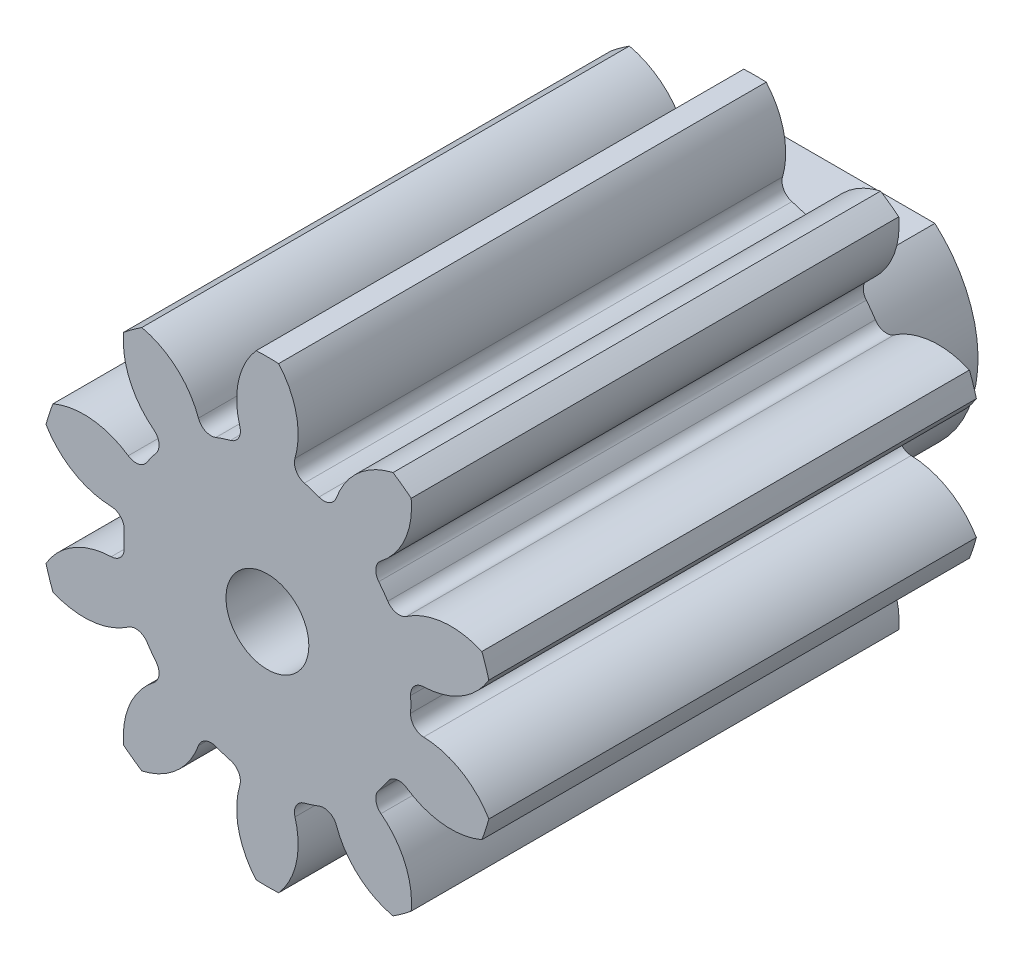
ISO-10303-21;
HEADER;
FILE_DESCRIPTION(('STEP AP214'),'2;1');
FILE_NAME('part.step','',(''),(''),'','','');
FILE_SCHEMA(('AUTOMOTIVE_DESIGN { 1 0 10303 214 1 1 1 1 }'));
ENDSEC;
DATA;
#1=APPLICATION_CONTEXT('core data for automotive mechanical design processes');
#2=APPLICATION_PROTOCOL_DEFINITION('international standard','automotive_design',2000,#1);
#3=PRODUCT_CONTEXT('',#1,'mechanical');
#4=PRODUCT('Part','Part','',(#3));
#5=PRODUCT_RELATED_PRODUCT_CATEGORY('part','',(#4));
#6=PRODUCT_DEFINITION_FORMATION('','',#4);
#7=PRODUCT_DEFINITION_CONTEXT('part definition',#1,'design');
#8=PRODUCT_DEFINITION('design','',#6,#7);
#9=PRODUCT_DEFINITION_SHAPE('','',#8);
#10=(LENGTH_UNIT() NAMED_UNIT(*) SI_UNIT(.MILLI.,.METRE.));
#11=(NAMED_UNIT(*) PLANE_ANGLE_UNIT() SI_UNIT($,.RADIAN.));
#12=(NAMED_UNIT(*) SI_UNIT($,.STERADIAN.) SOLID_ANGLE_UNIT());
#13=UNCERTAINTY_MEASURE_WITH_UNIT(LENGTH_MEASURE(1.E-05),#10,'distance_accuracy_value','');
#14=(GEOMETRIC_REPRESENTATION_CONTEXT(3) GLOBAL_UNCERTAINTY_ASSIGNED_CONTEXT((#13)) GLOBAL_UNIT_ASSIGNED_CONTEXT((#10,
#11,#12)) REPRESENTATION_CONTEXT('',''));
#15=CARTESIAN_POINT('',(0.,0.,0.));
#16=DIRECTION('',(0.,0.,1.));
#17=DIRECTION('',(1.,0.,0.));
#18=AXIS2_PLACEMENT_3D('',#15,#16,#17);
#19=CARTESIAN_POINT('',(0.,0.,1.5));
#20=DIRECTION('',(0.,0.,-1.));
#21=DIRECTION('',(-1.,0.,0.));
#22=AXIS2_PLACEMENT_3D('',#19,#20,#21);
#23=CYLINDRICAL_SURFACE('',#22,2.);
#24=CARTESIAN_POINT('',(0.,0.,0.));
#25=DIRECTION('',(0.,0.,1.));
#26=DIRECTION('',(1.,0.,0.));
#27=AXIS2_PLACEMENT_3D('',#24,#25,#26);
#28=CIRCLE('',#27,2.);
#29=CARTESIAN_POINT('',(-1.3228756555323,1.5,0.));
#30=VERTEX_POINT('',#29);
#31=CARTESIAN_POINT('',(1.3228756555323,1.5,0.));
#32=VERTEX_POINT('',#31);
#33=EDGE_CURVE('E680',#30,#32,#28,.T.);
#34=ORIENTED_EDGE('',*,*,#33,.T.);
#35=DIRECTION('',(0.,0.,-1.));
#36=VECTOR('',#35,1.);
#37=CARTESIAN_POINT('',(1.3228756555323,1.5,1.5));
#38=LINE('',#37,#36);
#39=CARTESIAN_POINT('',(1.3228756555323,1.5,1.5));
#40=VERTEX_POINT('',#39);
#41=EDGE_CURVE('E693',#40,#32,#38,.T.);
#42=ORIENTED_EDGE('',*,*,#41,.F.);
#43=CARTESIAN_POINT('',(0.,0.,1.5));
#44=DIRECTION('',(0.,0.,1.));
#45=DIRECTION('',(1.,0.,0.));
#46=AXIS2_PLACEMENT_3D('',#43,#44,#45);
#47=CIRCLE('',#46,2.);
#48=CARTESIAN_POINT('',(-1.3228756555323,1.5,1.5));
#49=VERTEX_POINT('',#48);
#50=EDGE_CURVE('E686',#49,#40,#47,.T.);
#51=ORIENTED_EDGE('',*,*,#50,.F.);
#52=DIRECTION('',(0.,0.,-1.));
#53=VECTOR('',#52,1.);
#54=CARTESIAN_POINT('',(-1.3228756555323,1.5,1.5));
#55=LINE('',#54,#53);
#56=EDGE_CURVE('E691',#49,#30,#55,.T.);
#57=ORIENTED_EDGE('',*,*,#56,.T.);
#58=EDGE_LOOP('',(#34,#42,#51,#57));
#59=FACE_BOUND('',#58,.T.);
#60=ADVANCED_FACE('F26',(#59),#23,.T.);
#61=CARTESIAN_POINT('',(-1.3228756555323,1.5,1.5));
#62=DIRECTION('',(0.,1.,0.));
#63=DIRECTION('',(-1.,0.,0.));
#64=AXIS2_PLACEMENT_3D('',#61,#62,#63);
#65=PLANE('',#64);
#66=DIRECTION('',(1.,0.,0.));
#67=VECTOR('',#66,1.);
#68=CARTESIAN_POINT('',(-1.3228756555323,1.5,0.));
#69=LINE('',#68,#67);
#70=EDGE_CURVE('E683',#30,#32,#69,.T.);
#71=ORIENTED_EDGE('',*,*,#70,.F.);
#72=ORIENTED_EDGE('',*,*,#56,.F.);
#73=DIRECTION('',(1.,0.,0.));
#74=VECTOR('',#73,1.);
#75=CARTESIAN_POINT('',(-1.3228756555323,1.5,1.5));
#76=LINE('',#75,#74);
#77=EDGE_CURVE('E689',#49,#40,#76,.T.);
#78=ORIENTED_EDGE('',*,*,#77,.T.);
#79=ORIENTED_EDGE('',*,*,#41,.T.);
#80=EDGE_LOOP('',(#71,#72,#78,#79));
#81=FACE_BOUND('',#80,.T.);
#82=ADVANCED_FACE('F1152',(#81),#65,.T.);
#83=CARTESIAN_POINT('',(0.,0.,0.));
#84=DIRECTION('',(0.,0.,1.));
#85=DIRECTION('',(1.,0.,0.));
#86=AXIS2_PLACEMENT_3D('',#83,#84,#85);
#87=PLANE('',#86);
#88=CARTESIAN_POINT('',(0.,0.,0.));
#89=DIRECTION('',(0.,0.,1.));
#90=DIRECTION('',(1.,0.,0.));
#91=AXIS2_PLACEMENT_3D('',#88,#89,#90);
#92=CIRCLE('',#91,0.65);
#93=CARTESIAN_POINT('',(0.65,0.,0.));
#94=VERTEX_POINT('',#93);
#95=EDGE_CURVE('E438',#94,#94,#92,.T.);
#96=ORIENTED_EDGE('',*,*,#95,.T.);
#97=EDGE_LOOP('',(#96));
#98=FACE_BOUND('',#97,.T.);
#99=ORIENTED_EDGE('',*,*,#33,.F.);
#100=ORIENTED_EDGE('',*,*,#70,.T.);
#101=EDGE_LOOP('',(#99,#100));
#102=FACE_BOUND('',#101,.T.);
#103=ADVANCED_FACE('F1157',(#98,#102),#87,.F.);
#104=CARTESIAN_POINT('',(0.,0.,9.15));
#105=DIRECTION('',(0.,0.,-1.));
#106=DIRECTION('',(-1.,0.,0.));
#107=AXIS2_PLACEMENT_3D('',#104,#105,#106);
#108=CYLINDRICAL_SURFACE('',#107,2.25);
#109=CARTESIAN_POINT('',(0.,0.,9.15));
#110=DIRECTION('',(0.,0.,1.));
#111=DIRECTION('',(1.,0.,0.));
#112=AXIS2_PLACEMENT_3D('',#109,#110,#111);
#113=CIRCLE('',#112,2.25);
#114=CARTESIAN_POINT('',(0.808850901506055,2.09958572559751,9.15));
#115=VERTEX_POINT('',#114);
#116=CARTESIAN_POINT('',(0.579731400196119,2.17403116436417,9.15));
#117=VERTEX_POINT('',#116);
#118=EDGE_CURVE('E663',#115,#117,#113,.T.);
#119=ORIENTED_EDGE('',*,*,#118,.F.);
#120=DIRECTION('',(0.,0.,-1.));
#121=VECTOR('',#120,1.);
#122=CARTESIAN_POINT('',(0.808850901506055,2.09958572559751,9.15));
#123=LINE('',#122,#121);
#124=CARTESIAN_POINT('',(0.808850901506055,2.09958572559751,1.5));
#125=VERTEX_POINT('',#124);
#126=EDGE_CURVE('E722',#115,#125,#123,.T.);
#127=ORIENTED_EDGE('',*,*,#126,.T.);
#128=CARTESIAN_POINT('',(0.,0.,1.5));
#129=DIRECTION('',(0.,0.,1.));
#130=DIRECTION('',(1.,0.,0.));
#131=AXIS2_PLACEMENT_3D('',#128,#129,#130);
#132=CIRCLE('',#131,2.25);
#133=CARTESIAN_POINT('',(0.579731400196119,2.17403116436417,1.5));
#134=VERTEX_POINT('',#133);
#135=EDGE_CURVE('E651',#125,#134,#132,.T.);
#136=ORIENTED_EDGE('',*,*,#135,.T.);
#137=DIRECTION('',(0.,0.,-1.));
#138=VECTOR('',#137,1.);
#139=CARTESIAN_POINT('',(0.579731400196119,2.17403116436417,9.15));
#140=LINE('',#139,#138);
#141=EDGE_CURVE('E698',#134,#117,#140,.F.);
#142=ORIENTED_EDGE('',*,*,#141,.T.);
#143=EDGE_LOOP('',(#119,#127,#136,#142));
#144=FACE_BOUND('',#143,.T.);
#145=ADVANCED_FACE('F923',(#144),#108,.T.);
#146=CARTESIAN_POINT('',(-0.747394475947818,2.78361952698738,9.15));
#147=DIRECTION('',(0.,0.,-1.));
#148=DIRECTION('',(-1.,0.,0.));
#149=AXIS2_PLACEMENT_3D('',#146,#147,#148);
#150=CYLINDRICAL_SURFACE('',#149,1.22985950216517);
#151=CARTESIAN_POINT('',(-0.747394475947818,2.78361952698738,9.15));
#152=DIRECTION('',(0.,0.,-1.));
#153=DIRECTION('',(-1.,0.,0.));
#154=AXIS2_PLACEMENT_3D('',#151,#152,#153);
#155=CIRCLE('',#154,1.22985950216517);
#156=CARTESIAN_POINT('',(0.176243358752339,3.59568328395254,9.15));
#157=VERTEX_POINT('',#156);
#158=CARTESIAN_POINT('',(0.432390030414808,2.43625384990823,9.15));
#159=VERTEX_POINT('',#158);
#160=EDGE_CURVE('E665',#157,#159,#155,.T.);
#161=ORIENTED_EDGE('',*,*,#160,.T.);
#162=DIRECTION('',(0.,0.,-1.));
#163=VECTOR('',#162,1.);
#164=CARTESIAN_POINT('',(0.432390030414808,2.43625384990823,9.15));
#165=LINE('',#164,#163);
#166=CARTESIAN_POINT('',(0.432390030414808,2.43625384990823,1.5));
#167=VERTEX_POINT('',#166);
#168=EDGE_CURVE('E695',#159,#167,#165,.T.);
#169=ORIENTED_EDGE('',*,*,#168,.T.);
#170=CARTESIAN_POINT('',(-0.747394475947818,2.78361952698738,1.5));
#171=DIRECTION('',(0.,0.,-1.));
#172=DIRECTION('',(-1.,0.,0.));
#173=AXIS2_PLACEMENT_3D('',#170,#171,#172);
#174=CIRCLE('',#173,1.22985950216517);
#175=CARTESIAN_POINT('',(0.176243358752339,3.59568328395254,1.5));
#176=VERTEX_POINT('',#175);
#177=EDGE_CURVE('E653',#176,#167,#174,.T.);
#178=ORIENTED_EDGE('',*,*,#177,.F.);
#179=DIRECTION('',(0.,0.,-1.));
#180=VECTOR('',#179,1.);
#181=CARTESIAN_POINT('',(0.176243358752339,3.59568328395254,9.15));
#182=LINE('',#181,#180);
#183=EDGE_CURVE('E678',#157,#176,#182,.T.);
#184=ORIENTED_EDGE('',*,*,#183,.F.);
#185=EDGE_LOOP('',(#161,#169,#178,#184));
#186=FACE_BOUND('',#185,.T.);
#187=ADVANCED_FACE('F914',(#186),#150,.T.);
#188=CARTESIAN_POINT('',(0.,0.,9.15));
#189=DIRECTION('',(0.,0.,-1.));
#190=DIRECTION('',(-1.,0.,0.));
#191=AXIS2_PLACEMENT_3D('',#188,#189,#190);
#192=CYLINDRICAL_SURFACE('',#191,3.6);
#193=CARTESIAN_POINT('',(0.,0.,1.5));
#194=DIRECTION('',(0.,0.,1.));
#195=DIRECTION('',(1.,0.,0.));
#196=AXIS2_PLACEMENT_3D('',#193,#194,#195);
#197=CIRCLE('',#196,3.6);
#198=CARTESIAN_POINT('',(-0.176243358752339,3.59568328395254,1.5));
#199=VERTEX_POINT('',#198);
#200=EDGE_CURVE('E656',#176,#199,#197,.T.);
#201=ORIENTED_EDGE('',*,*,#200,.T.);
#202=DIRECTION('',(0.,0.,-1.));
#203=VECTOR('',#202,1.);
#204=CARTESIAN_POINT('',(-0.176243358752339,3.59568328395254,9.15));
#205=LINE('',#204,#203);
#206=CARTESIAN_POINT('',(-0.176243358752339,3.59568328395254,9.15));
#207=VERTEX_POINT('',#206);
#208=EDGE_CURVE('E675',#207,#199,#205,.T.);
#209=ORIENTED_EDGE('',*,*,#208,.F.);
#210=CARTESIAN_POINT('',(0.,0.,9.15));
#211=DIRECTION('',(0.,0.,1.));
#212=DIRECTION('',(1.,0.,0.));
#213=AXIS2_PLACEMENT_3D('',#210,#211,#212);
#214=CIRCLE('',#213,3.6);
#215=EDGE_CURVE('E668',#157,#207,#214,.T.);
#216=ORIENTED_EDGE('',*,*,#215,.F.);
#217=ORIENTED_EDGE('',*,*,#183,.T.);
#218=EDGE_LOOP('',(#201,#209,#216,#217));
#219=FACE_BOUND('',#218,.T.);
#220=ADVANCED_FACE('F910',(#219),#192,.T.);
#221=CARTESIAN_POINT('',(0.747394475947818,2.78361952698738,9.15));
#222=DIRECTION('',(0.,0.,-1.));
#223=DIRECTION('',(-1.,0.,0.));
#224=AXIS2_PLACEMENT_3D('',#221,#222,#223);
#225=CYLINDRICAL_SURFACE('',#224,1.22985950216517);
#226=CARTESIAN_POINT('',(0.747394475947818,2.78361952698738,1.5));
#227=DIRECTION('',(0.,0.,1.));
#228=DIRECTION('',(1.,0.,0.));
#229=AXIS2_PLACEMENT_3D('',#226,#227,#228);
#230=CIRCLE('',#229,1.22985950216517);
#231=CARTESIAN_POINT('',(-0.432390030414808,2.43625384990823,1.5));
#232=VERTEX_POINT('',#231);
#233=EDGE_CURVE('E658',#199,#232,#230,.T.);
#234=ORIENTED_EDGE('',*,*,#233,.T.);
#235=DIRECTION('',(0.,0.,-1.));
#236=VECTOR('',#235,1.);
#237=CARTESIAN_POINT('',(-0.432390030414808,2.43625384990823,9.15));
#238=LINE('',#237,#236);
#239=CARTESIAN_POINT('',(-0.432390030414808,2.43625384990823,9.15));
#240=VERTEX_POINT('',#239);
#241=EDGE_CURVE('E704',#232,#240,#238,.F.);
#242=ORIENTED_EDGE('',*,*,#241,.T.);
#243=CARTESIAN_POINT('',(0.747394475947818,2.78361952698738,9.15));
#244=DIRECTION('',(0.,0.,1.));
#245=DIRECTION('',(1.,0.,0.));
#246=AXIS2_PLACEMENT_3D('',#243,#244,#245);
#247=CIRCLE('',#246,1.22985950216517);
#248=EDGE_CURVE('E670',#207,#240,#247,.T.);
#249=ORIENTED_EDGE('',*,*,#248,.F.);
#250=ORIENTED_EDGE('',*,*,#208,.T.);
#251=EDGE_LOOP('',(#234,#242,#249,#250));
#252=FACE_BOUND('',#251,.T.);
#253=ADVANCED_FACE('F905',(#252),#225,.T.);
#254=CARTESIAN_POINT('',(0.,0.,9.15));
#255=DIRECTION('',(0.,0.,-1.));
#256=DIRECTION('',(-1.,0.,0.));
#257=AXIS2_PLACEMENT_3D('',#254,#255,#256);
#258=CYLINDRICAL_SURFACE('',#257,2.25);
#259=CARTESIAN_POINT('',(0.,0.,1.5));
#260=DIRECTION('',(0.,0.,-1.));
#261=DIRECTION('',(-1.,0.,0.));
#262=AXIS2_PLACEMENT_3D('',#259,#260,#261);
#263=CIRCLE('',#262,2.25);
#264=CARTESIAN_POINT('',(-0.808850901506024,2.09958572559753,1.5));
#265=VERTEX_POINT('',#264);
#266=CARTESIAN_POINT('',(-0.579731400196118,2.17403116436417,1.5));
#267=VERTEX_POINT('',#266);
#268=EDGE_CURVE('E661',#265,#267,#263,.T.);
#269=ORIENTED_EDGE('',*,*,#268,.F.);
#270=DIRECTION('',(0.,0.,-1.));
#271=VECTOR('',#270,1.);
#272=CARTESIAN_POINT('',(-0.808850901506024,2.09958572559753,9.15));
#273=LINE('',#272,#271);
#274=CARTESIAN_POINT('',(-0.808850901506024,2.09958572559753,9.15));
#275=VERTEX_POINT('',#274);
#276=EDGE_CURVE('E877',#265,#275,#273,.F.);
#277=ORIENTED_EDGE('',*,*,#276,.T.);
#278=CARTESIAN_POINT('',(0.,0.,9.15));
#279=DIRECTION('',(0.,0.,-1.));
#280=DIRECTION('',(-1.,0.,0.));
#281=AXIS2_PLACEMENT_3D('',#278,#279,#280);
#282=CIRCLE('',#281,2.25);
#283=CARTESIAN_POINT('',(-0.579731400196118,2.17403116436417,9.15));
#284=VERTEX_POINT('',#283);
#285=EDGE_CURVE('E673',#275,#284,#282,.T.);
#286=ORIENTED_EDGE('',*,*,#285,.T.);
#287=DIRECTION('',(0.,0.,-1.));
#288=VECTOR('',#287,1.);
#289=CARTESIAN_POINT('',(-0.579731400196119,2.17403116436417,9.15));
#290=LINE('',#289,#288);
#291=EDGE_CURVE('E701',#284,#267,#290,.T.);
#292=ORIENTED_EDGE('',*,*,#291,.T.);
#293=EDGE_LOOP('',(#269,#277,#286,#292));
#294=FACE_BOUND('',#293,.T.);
#295=ADVANCED_FACE('F896',(#294),#258,.T.);
#296=CARTESIAN_POINT('',(0.,0.,9.15));
#297=DIRECTION('',(0.,0.,1.));
#298=DIRECTION('',(1.,0.,0.));
#299=AXIS2_PLACEMENT_3D('',#296,#297,#298);
#300=PLANE('',#299);
#301=CARTESIAN_POINT('',(0.,0.,9.15));
#302=DIRECTION('',(0.,0.,1.));
#303=DIRECTION('',(1.,0.,0.));
#304=AXIS2_PLACEMENT_3D('',#301,#302,#303);
#305=CIRCLE('',#304,0.65);
#306=CARTESIAN_POINT('',(0.65,0.,9.15));
#307=VERTEX_POINT('',#306);
#308=EDGE_CURVE('E441',#307,#307,#305,.T.);
#309=ORIENTED_EDGE('',*,*,#308,.F.);
#310=EDGE_LOOP('',(#309));
#311=FACE_BOUND('',#310,.T.);
#312=CARTESIAN_POINT('',(2.24082533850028,1.81268805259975,9.15));
#313=DIRECTION('',(0.,0.,1.));
#314=DIRECTION('',(0.809016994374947,-0.587785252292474,0.));
#315=AXIS2_PLACEMENT_3D('',#312,#313,#314);
#316=CIRCLE('',#315,1.22985950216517);
#317=CARTESIAN_POINT('',(1.97090573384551,3.01256213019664,9.15));
#318=VERTEX_POINT('',#317);
#319=CARTESIAN_POINT('',(1.08218320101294,2.22512325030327,9.15));
#320=VERTEX_POINT('',#319);
#321=EDGE_CURVE('E643',#318,#320,#316,.T.);
#322=ORIENTED_EDGE('',*,*,#321,.T.);
#323=CARTESIAN_POINT('',(0.884343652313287,2.29554705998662,9.15));
#324=DIRECTION('',(0.,0.,1.));
#325=DIRECTION('',(1.,0.,0.));
#326=AXIS2_PLACEMENT_3D('',#323,#324,#325);
#327=CIRCLE('',#326,0.21);
#328=EDGE_CURVE('E734',#320,#115,#327,.F.);
#329=ORIENTED_EDGE('',*,*,#328,.T.);
#330=ORIENTED_EDGE('',*,*,#118,.T.);
#331=CARTESIAN_POINT('',(0.633839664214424,2.37694073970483,9.15));
#332=DIRECTION('',(0.,0.,1.));
#333=DIRECTION('',(1.,0.,0.));
#334=AXIS2_PLACEMENT_3D('',#331,#332,#333);
#335=CIRCLE('',#334,0.21);
#336=EDGE_CURVE('E709',#117,#159,#335,.F.);
#337=ORIENTED_EDGE('',*,*,#336,.T.);
#338=ORIENTED_EDGE('',*,*,#160,.F.);
#339=ORIENTED_EDGE('',*,*,#215,.T.);
#340=ORIENTED_EDGE('',*,*,#248,.T.);
#341=CARTESIAN_POINT('',(-0.633839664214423,2.37694073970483,9.15));
#342=DIRECTION('',(0.,0.,1.));
#343=DIRECTION('',(1.,0.,0.));
#344=AXIS2_PLACEMENT_3D('',#341,#342,#343);
#345=CIRCLE('',#344,0.21);
#346=EDGE_CURVE('E713',#240,#284,#345,.F.);
#347=ORIENTED_EDGE('',*,*,#346,.T.);
#348=ORIENTED_EDGE('',*,*,#285,.F.);
#349=CARTESIAN_POINT('',(-0.884343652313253,2.29554705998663,9.15));
#350=DIRECTION('',(0.,0.,1.));
#351=DIRECTION('',(1.,0.,0.));
#352=AXIS2_PLACEMENT_3D('',#349,#350,#351);
#353=CIRCLE('',#352,0.21);
#354=CARTESIAN_POINT('',(-1.08218320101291,2.22512325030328,9.15));
#355=VERTEX_POINT('',#354);
#356=EDGE_CURVE('E885',#275,#355,#353,.F.);
#357=ORIENTED_EDGE('',*,*,#356,.T.);
#358=CARTESIAN_POINT('',(-2.24082533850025,1.81268805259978,9.15));
#359=DIRECTION('',(0.,0.,-1.));
#360=DIRECTION('',(-0.809016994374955,-0.587785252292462,0.));
#361=AXIS2_PLACEMENT_3D('',#358,#359,#360);
#362=CIRCLE('',#361,1.22985950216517);
#363=CARTESIAN_POINT('',(-1.97090573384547,3.01256213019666,9.15));
#364=VERTEX_POINT('',#363);
#365=EDGE_CURVE('E446',#364,#355,#362,.T.);
#366=ORIENTED_EDGE('',*,*,#365,.F.);
#367=CARTESIAN_POINT('',(0.,0.,9.15));
#368=DIRECTION('',(0.,0.,1.));
#369=DIRECTION('',(0.809016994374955,0.587785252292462,0.));
#370=AXIS2_PLACEMENT_3D('',#367,#368,#369);
#371=CIRCLE('',#370,3.6);
#372=CARTESIAN_POINT('',(-2.2560734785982,2.80537563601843,9.15));
#373=VERTEX_POINT('',#372);
#374=EDGE_CURVE('E419',#364,#373,#371,.T.);
#375=ORIENTED_EDGE('',*,*,#374,.T.);
#376=CARTESIAN_POINT('',(-1.03151567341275,2.69130295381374,9.15));
#377=DIRECTION('',(0.,0.,1.));
#378=DIRECTION('',(0.809016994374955,0.587785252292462,0.));
#379=AXIS2_PLACEMENT_3D('',#376,#377,#378);
#380=CIRCLE('',#379,1.22985950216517);
#381=CARTESIAN_POINT('',(-1.78180496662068,1.71681828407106,9.15));
#382=VERTEX_POINT('',#381);
#383=EDGE_CURVE('E449',#373,#382,#380,.T.);
#384=ORIENTED_EDGE('',*,*,#383,.T.);
#385=CARTESIAN_POINT('',(-1.90991777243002,1.55042384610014,9.15));
#386=DIRECTION('',(0.,0.,1.));
#387=DIRECTION('',(1.,0.,0.));
#388=AXIS2_PLACEMENT_3D('',#385,#386,#387);
#389=CIRCLE('',#388,0.21);
#390=CARTESIAN_POINT('',(-1.74687601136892,1.41807059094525,9.15));
#391=VERTEX_POINT('',#390);
#392=EDGE_CURVE('E11',#382,#391,#389,.F.);
#393=ORIENTED_EDGE('',*,*,#392,.T.);
#394=CARTESIAN_POINT('',(0.,0.,9.15));
#395=DIRECTION('',(0.,0.,1.));
#396=DIRECTION('',(0.309016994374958,0.95105651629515,0.));
#397=AXIS2_PLACEMENT_3D('',#394,#395,#396);
#398=CIRCLE('',#397,2.25);
#399=CARTESIAN_POINT('',(-1.88847965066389,1.22316990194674,9.15));
#400=VERTEX_POINT('',#399);
#401=EDGE_CURVE('E461',#391,#400,#398,.T.);
#402=ORIENTED_EDGE('',*,*,#401,.T.);
#403=CARTESIAN_POINT('',(-2.06473775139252,1.33733242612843,9.15));
#404=DIRECTION('',(0.,0.,1.));
#405=DIRECTION('',(1.,0.,0.));
#406=AXIS2_PLACEMENT_3D('',#403,#404,#405);
#407=CIRCLE('',#406,0.21);
#408=CARTESIAN_POINT('',(-2.18339923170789,1.16407119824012,9.15));
#409=VERTEX_POINT('',#408);
#410=EDGE_CURVE('E870',#400,#409,#407,.F.);
#411=ORIENTED_EDGE('',*,*,#410,.T.);
#412=CARTESIAN_POINT('',(-2.87833708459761,0.149371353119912,9.15));
#413=DIRECTION('',(0.,0.,-1.));
#414=DIRECTION('',(-0.309016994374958,-0.95105651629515,0.));
#415=AXIS2_PLACEMENT_3D('',#412,#413,#414);
#416=CIRCLE('',#415,1.22985950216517);
#417=CARTESIAN_POINT('',(-3.36523582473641,1.27874463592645,9.15));
#418=VERTEX_POINT('',#417);
#419=EDGE_CURVE('E463',#418,#409,#416,.T.);
#420=ORIENTED_EDGE('',*,*,#419,.F.);
#421=CARTESIAN_POINT('',(0.,0.,9.15));
#422=DIRECTION('',(0.,0.,1.));
#423=DIRECTION('',(0.309016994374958,0.95105651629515,0.));
#424=AXIS2_PLACEMENT_3D('',#421,#422,#423);
#425=CIRCLE('',#424,3.6);
#426=CARTESIAN_POINT('',(-3.4741602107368,0.943509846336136,9.15));
#427=VERTEX_POINT('',#426);
#428=EDGE_CURVE('E466',#418,#427,#425,.T.);
#429=ORIENTED_EDGE('',*,*,#428,.T.);
#430=CARTESIAN_POINT('',(-2.41642189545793,1.57100012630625,9.15));
#431=DIRECTION('',(0.,0.,1.));
#432=DIRECTION('',(0.309016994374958,0.95105651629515,0.));
#433=AXIS2_PLACEMENT_3D('',#430,#431,#432);
#434=CIRCLE('',#433,1.22985950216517);
#435=CARTESIAN_POINT('',(-2.45063096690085,0.341616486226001,9.15));
#436=VERTEX_POINT('',#435);
#437=EDGE_CURVE('E468',#427,#436,#434,.T.);
#438=ORIENTED_EDGE('',*,*,#437,.T.);
#439=CARTESIAN_POINT('',(-2.45647220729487,0.13169774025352,9.15));
#440=DIRECTION('',(0.,0.,1.));
#441=DIRECTION('',(1.,0.,0.));
#442=AXIS2_PLACEMENT_3D('',#439,#440,#441);
#443=CIRCLE('',#442,0.21);
#444=CARTESIAN_POINT('',(-2.24677336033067,0.120455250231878,9.15));
#445=VERTEX_POINT('',#444);
#446=EDGE_CURVE('E874',#436,#445,#443,.F.);
#447=ORIENTED_EDGE('',*,*,#446,.T.);
#448=CARTESIAN_POINT('',(0.,0.,9.15));
#449=DIRECTION('',(0.,0.,1.));
#450=DIRECTION('',(-0.309016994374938,0.951056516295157,0.));
#451=AXIS2_PLACEMENT_3D('',#448,#449,#450);
#452=CIRCLE('',#451,2.25);
#453=CARTESIAN_POINT('',(-2.24677336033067,-0.12045525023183,9.15));
#454=VERTEX_POINT('',#453);
#455=EDGE_CURVE('E486',#445,#454,#452,.T.);
#456=ORIENTED_EDGE('',*,*,#455,.T.);
#457=CARTESIAN_POINT('',(-2.45647220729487,-0.131697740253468,9.15));
#458=DIRECTION('',(0.,0.,1.));
#459=DIRECTION('',(1.,0.,0.));
#460=AXIS2_PLACEMENT_3D('',#457,#458,#459);
#461=CIRCLE('',#460,0.21);
#462=CARTESIAN_POINT('',(-2.45063096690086,-0.341616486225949,9.15));
#463=VERTEX_POINT('',#462);
#464=EDGE_CURVE('E850',#454,#463,#461,.F.);
#465=ORIENTED_EDGE('',*,*,#464,.T.);
#466=CARTESIAN_POINT('',(-2.41642189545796,-1.5710001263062,9.15));
#467=DIRECTION('',(0.,0.,-1.));
#468=DIRECTION('',(0.309016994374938,-0.951056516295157,0.));
#469=AXIS2_PLACEMENT_3D('',#466,#467,#468);
#470=CIRCLE('',#469,1.22985950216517);
#471=CARTESIAN_POINT('',(-3.47416021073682,-0.943509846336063,9.15));
#472=VERTEX_POINT('',#471);
#473=EDGE_CURVE('E488',#472,#463,#470,.T.);
#474=ORIENTED_EDGE('',*,*,#473,.F.);
#475=CARTESIAN_POINT('',(0.,0.,9.15));
#476=DIRECTION('',(0.,0.,1.));
#477=DIRECTION('',(-0.309016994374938,0.951056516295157,0.));
#478=AXIS2_PLACEMENT_3D('',#475,#476,#477);
#479=CIRCLE('',#478,3.6);
#480=CARTESIAN_POINT('',(-3.36523582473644,-1.27874463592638,9.15));
#481=VERTEX_POINT('',#480);
#482=EDGE_CURVE('E491',#472,#481,#479,.T.);
#483=ORIENTED_EDGE('',*,*,#482,.T.);
#484=CARTESIAN_POINT('',(-2.87833708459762,-0.149371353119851,9.15));
#485=DIRECTION('',(0.,0.,1.));
#486=DIRECTION('',(-0.309016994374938,0.951056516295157,0.));
#487=AXIS2_PLACEMENT_3D('',#484,#485,#486);
#488=CIRCLE('',#487,1.22985950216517);
#489=CARTESIAN_POINT('',(-2.18339923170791,-1.16407119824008,9.15));
#490=VERTEX_POINT('',#489);
#491=EDGE_CURVE('E493',#481,#490,#488,.T.);
#492=ORIENTED_EDGE('',*,*,#491,.T.);
#493=CARTESIAN_POINT('',(-2.06473775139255,-1.33733242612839,9.15));
#494=DIRECTION('',(0.,0.,1.));
#495=DIRECTION('',(1.,0.,0.));
#496=AXIS2_PLACEMENT_3D('',#493,#494,#495);
#497=CIRCLE('',#496,0.21);
#498=CARTESIAN_POINT('',(-1.88847965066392,-1.2231699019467,9.15));
#499=VERTEX_POINT('',#498);
#500=EDGE_CURVE('E854',#490,#499,#497,.F.);
#501=ORIENTED_EDGE('',*,*,#500,.T.);
#502=CARTESIAN_POINT('',(0.,0.,9.15));
#503=DIRECTION('',(0.,0.,1.));
#504=DIRECTION('',(-0.809016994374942,0.58778525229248,0.));
#505=AXIS2_PLACEMENT_3D('',#502,#503,#504);
#506=CIRCLE('',#505,2.25);
#507=CARTESIAN_POINT('',(-1.74687601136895,-1.41807059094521,9.15));
#508=VERTEX_POINT('',#507);
#509=EDGE_CURVE('E511',#499,#508,#506,.T.);
#510=ORIENTED_EDGE('',*,*,#509,.T.);
#511=CARTESIAN_POINT('',(-1.90991777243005,-1.5504238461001,9.15));
#512=DIRECTION('',(0.,0.,1.));
#513=DIRECTION('',(1.,0.,0.));
#514=AXIS2_PLACEMENT_3D('',#511,#512,#513);
#515=CIRCLE('',#514,0.21);
#516=CARTESIAN_POINT('',(-1.78180496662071,-1.71681828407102,9.15));
#517=VERTEX_POINT('',#516);
#518=EDGE_CURVE('E830',#508,#517,#515,.F.);
#519=ORIENTED_EDGE('',*,*,#518,.T.);
#520=CARTESIAN_POINT('',(-1.03151567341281,-2.69130295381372,9.15));
#521=DIRECTION('',(0.,0.,-1.));
#522=DIRECTION('',(0.809016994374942,-0.58778525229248,0.));
#523=AXIS2_PLACEMENT_3D('',#520,#521,#522);
#524=CIRCLE('',#523,1.22985950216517);
#525=CARTESIAN_POINT('',(-2.25607347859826,-2.80537563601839,9.15));
#526=VERTEX_POINT('',#525);
#527=EDGE_CURVE('E513',#526,#517,#524,.T.);
#528=ORIENTED_EDGE('',*,*,#527,.F.);
#529=CARTESIAN_POINT('',(0.,0.,9.15));
#530=DIRECTION('',(0.,0.,1.));
#531=DIRECTION('',(-0.809016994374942,0.58778525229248,0.));
#532=AXIS2_PLACEMENT_3D('',#529,#530,#531);
#533=CIRCLE('',#532,3.6);
#534=CARTESIAN_POINT('',(-1.97090573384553,-3.01256213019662,9.15));
#535=VERTEX_POINT('',#534);
#536=EDGE_CURVE('E516',#526,#535,#533,.T.);
#537=ORIENTED_EDGE('',*,*,#536,.T.);
#538=CARTESIAN_POINT('',(-2.24082533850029,-1.81268805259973,9.15));
#539=DIRECTION('',(0.,0.,1.));
#540=DIRECTION('',(-0.809016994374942,0.58778525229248,0.));
#541=AXIS2_PLACEMENT_3D('',#538,#539,#540);
#542=CIRCLE('',#541,1.22985950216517);
#543=CARTESIAN_POINT('',(-1.08218320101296,-2.22512325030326,9.15));
#544=VERTEX_POINT('',#543);
#545=EDGE_CURVE('E518',#535,#544,#542,.T.);
#546=ORIENTED_EDGE('',*,*,#545,.T.);
#547=CARTESIAN_POINT('',(-0.884343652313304,-2.29554705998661,9.15));
#548=DIRECTION('',(0.,0.,1.));
#549=DIRECTION('',(1.,0.,0.));
#550=AXIS2_PLACEMENT_3D('',#547,#548,#549);
#551=CIRCLE('',#550,0.21);
#552=CARTESIAN_POINT('',(-0.80885090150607,-2.09958572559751,9.15));
#553=VERTEX_POINT('',#552);
#554=EDGE_CURVE('E834',#544,#553,#551,.F.);
#555=ORIENTED_EDGE('',*,*,#554,.T.);
#556=CARTESIAN_POINT('',(0.,0.,9.15));
#557=DIRECTION('',(0.,0.,1.));
#558=DIRECTION('',(-1.,0.,0.));
#559=AXIS2_PLACEMENT_3D('',#556,#557,#558);
#560=CIRCLE('',#559,2.25);
#561=CARTESIAN_POINT('',(-0.579731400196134,-2.17403116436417,9.15));
#562=VERTEX_POINT('',#561);
#563=EDGE_CURVE('E536',#553,#562,#560,.T.);
#564=ORIENTED_EDGE('',*,*,#563,.T.);
#565=CARTESIAN_POINT('',(-0.63383966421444,-2.37694073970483,9.15));
#566=DIRECTION('',(0.,0.,1.));
#567=DIRECTION('',(1.,0.,0.));
#568=AXIS2_PLACEMENT_3D('',#565,#566,#567);
#569=CIRCLE('',#568,0.21);
#570=CARTESIAN_POINT('',(-0.432390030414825,-2.43625384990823,9.15));
#571=VERTEX_POINT('',#570);
#572=EDGE_CURVE('E810',#562,#571,#569,.F.);
#573=ORIENTED_EDGE('',*,*,#572,.T.);
#574=CARTESIAN_POINT('',(0.747394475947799,-2.78361952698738,9.15));
#575=DIRECTION('',(0.,0.,-1.));
#576=DIRECTION('',(1.,0.,0.));
#577=AXIS2_PLACEMENT_3D('',#574,#575,#576);
#578=CIRCLE('',#577,1.22985950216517);
#579=CARTESIAN_POINT('',(-0.176243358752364,-3.59568328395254,9.15));
#580=VERTEX_POINT('',#579);
#581=EDGE_CURVE('E538',#580,#571,#578,.T.);
#582=ORIENTED_EDGE('',*,*,#581,.F.);
#583=CARTESIAN_POINT('',(0.,0.,9.15));
#584=DIRECTION('',(0.,0.,1.));
#585=DIRECTION('',(-1.,0.,0.));
#586=AXIS2_PLACEMENT_3D('',#583,#584,#585);
#587=CIRCLE('',#586,3.6);
#588=CARTESIAN_POINT('',(0.176243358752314,-3.59568328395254,9.15));
#589=VERTEX_POINT('',#588);
#590=EDGE_CURVE('E541',#580,#589,#587,.T.);
#591=ORIENTED_EDGE('',*,*,#590,.T.);
#592=CARTESIAN_POINT('',(-0.747394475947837,-2.78361952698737,9.15));
#593=DIRECTION('',(0.,0.,1.));
#594=DIRECTION('',(-1.,0.,0.));
#595=AXIS2_PLACEMENT_3D('',#592,#593,#594);
#596=CIRCLE('',#595,1.22985950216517);
#597=CARTESIAN_POINT('',(0.432390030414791,-2.43625384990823,9.15));
#598=VERTEX_POINT('',#597);
#599=EDGE_CURVE('E543',#589,#598,#596,.T.);
#600=ORIENTED_EDGE('',*,*,#599,.T.);
#601=CARTESIAN_POINT('',(0.633839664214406,-2.37694073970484,9.15));
#602=DIRECTION('',(0.,0.,1.));
#603=DIRECTION('',(1.,0.,0.));
#604=AXIS2_PLACEMENT_3D('',#601,#602,#603);
#605=CIRCLE('',#604,0.21);
#606=CARTESIAN_POINT('',(0.579731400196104,-2.17403116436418,9.15));
#607=VERTEX_POINT('',#606);
#608=EDGE_CURVE('E814',#598,#607,#605,.F.);
#609=ORIENTED_EDGE('',*,*,#608,.T.);
#610=CARTESIAN_POINT('',(0.,0.,9.15));
#611=DIRECTION('',(0.,0.,1.));
#612=DIRECTION('',(-0.809016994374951,-0.587785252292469,0.));
#613=AXIS2_PLACEMENT_3D('',#610,#611,#612);
#614=CIRCLE('',#613,2.25);
#615=CARTESIAN_POINT('',(0.80885090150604,-2.09958572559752,9.15));
#616=VERTEX_POINT('',#615);
#617=EDGE_CURVE('E561',#607,#616,#614,.T.);
#618=ORIENTED_EDGE('',*,*,#617,.T.);
#619=CARTESIAN_POINT('',(0.88434365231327,-2.29554705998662,9.15));
#620=DIRECTION('',(0.,0.,1.));
#621=DIRECTION('',(1.,0.,0.));
#622=AXIS2_PLACEMENT_3D('',#619,#620,#621);
#623=CIRCLE('',#622,0.21);
#624=CARTESIAN_POINT('',(1.08218320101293,-2.22512325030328,9.15));
#625=VERTEX_POINT('',#624);
#626=EDGE_CURVE('E790',#616,#625,#623,.F.);
#627=ORIENTED_EDGE('',*,*,#626,.T.);
#628=CARTESIAN_POINT('',(2.24082533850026,-1.81268805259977,9.15));
#629=DIRECTION('',(0.,0.,-1.));
#630=DIRECTION('',(0.809016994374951,0.587785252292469,0.));
#631=AXIS2_PLACEMENT_3D('',#628,#629,#630);
#632=CIRCLE('',#631,1.22985950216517);
#633=CARTESIAN_POINT('',(1.97090573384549,-3.01256213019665,9.15));
#634=VERTEX_POINT('',#633);
#635=EDGE_CURVE('E563',#634,#625,#632,.T.);
#636=ORIENTED_EDGE('',*,*,#635,.F.);
#637=CARTESIAN_POINT('',(0.,0.,9.15));
#638=DIRECTION('',(0.,0.,1.));
#639=DIRECTION('',(-0.809016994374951,-0.587785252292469,0.));
#640=AXIS2_PLACEMENT_3D('',#637,#638,#639);
#641=CIRCLE('',#640,3.6);
#642=CARTESIAN_POINT('',(2.25607347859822,-2.80537563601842,9.15));
#643=VERTEX_POINT('',#642);
#644=EDGE_CURVE('E566',#634,#643,#641,.T.);
#645=ORIENTED_EDGE('',*,*,#644,.T.);
#646=CARTESIAN_POINT('',(1.03151567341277,-2.69130295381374,9.15));
#647=DIRECTION('',(0.,0.,1.));
#648=DIRECTION('',(-0.809016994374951,-0.587785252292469,0.));
#649=AXIS2_PLACEMENT_3D('',#646,#647,#648);
#650=CIRCLE('',#649,1.22985950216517);
#651=CARTESIAN_POINT('',(1.78180496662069,-1.71681828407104,9.15));
#652=VERTEX_POINT('',#651);
#653=EDGE_CURVE('E568',#643,#652,#650,.T.);
#654=ORIENTED_EDGE('',*,*,#653,.T.);
#655=CARTESIAN_POINT('',(1.90991777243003,-1.55042384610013,9.15));
#656=DIRECTION('',(0.,0.,1.));
#657=DIRECTION('',(1.,0.,0.));
#658=AXIS2_PLACEMENT_3D('',#655,#656,#657);
#659=CIRCLE('',#658,0.21);
#660=CARTESIAN_POINT('',(1.74687601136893,-1.41807059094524,9.15));
#661=VERTEX_POINT('',#660);
#662=EDGE_CURVE('E794',#652,#661,#659,.F.);
#663=ORIENTED_EDGE('',*,*,#662,.T.);
#664=CARTESIAN_POINT('',(0.,0.,9.15));
#665=DIRECTION('',(0.,0.,1.));
#666=DIRECTION('',(-0.309016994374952,-0.951056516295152,0.));
#667=AXIS2_PLACEMENT_3D('',#664,#665,#666);
#668=CIRCLE('',#667,2.25);
#669=CARTESIAN_POINT('',(1.8884796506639,-1.22316990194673,9.15));
#670=VERTEX_POINT('',#669);
#671=EDGE_CURVE('E586',#661,#670,#668,.T.);
#672=ORIENTED_EDGE('',*,*,#671,.T.);
#673=CARTESIAN_POINT('',(2.06473775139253,-1.33733242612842,9.15));
#674=DIRECTION('',(0.,0.,1.));
#675=DIRECTION('',(1.,0.,0.));
#676=AXIS2_PLACEMENT_3D('',#673,#674,#675);
#677=CIRCLE('',#676,0.21);
#678=CARTESIAN_POINT('',(2.1833992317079,-1.16407119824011,9.15));
#679=VERTEX_POINT('',#678);
#680=EDGE_CURVE('E770',#670,#679,#677,.F.);
#681=ORIENTED_EDGE('',*,*,#680,.T.);
#682=CARTESIAN_POINT('',(2.87833708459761,-0.149371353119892,9.15));
#683=DIRECTION('',(0.,0.,-1.));
#684=DIRECTION('',(0.309016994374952,0.951056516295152,0.));
#685=AXIS2_PLACEMENT_3D('',#682,#683,#684);
#686=CIRCLE('',#685,1.22985950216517);
#687=CARTESIAN_POINT('',(3.36523582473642,-1.27874463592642,9.15));
#688=VERTEX_POINT('',#687);
#689=EDGE_CURVE('E588',#688,#679,#686,.T.);
#690=ORIENTED_EDGE('',*,*,#689,.F.);
#691=CARTESIAN_POINT('',(0.,0.,9.15));
#692=DIRECTION('',(0.,0.,1.));
#693=DIRECTION('',(-0.309016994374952,-0.951056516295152,0.));
#694=AXIS2_PLACEMENT_3D('',#691,#692,#693);
#695=CIRCLE('',#694,3.6);
#696=CARTESIAN_POINT('',(3.47416021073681,-0.943509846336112,9.15));
#697=VERTEX_POINT('',#696);
#698=EDGE_CURVE('E591',#688,#697,#695,.T.);
#699=ORIENTED_EDGE('',*,*,#698,.T.);
#700=CARTESIAN_POINT('',(2.41642189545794,-1.57100012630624,9.15));
#701=DIRECTION('',(0.,0.,1.));
#702=DIRECTION('',(-0.309016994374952,-0.951056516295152,0.));
#703=AXIS2_PLACEMENT_3D('',#700,#701,#702);
#704=CIRCLE('',#703,1.22985950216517);
#705=CARTESIAN_POINT('',(2.45063096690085,-0.341616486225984,9.15));
#706=VERTEX_POINT('',#705);
#707=EDGE_CURVE('E593',#697,#706,#704,.T.);
#708=ORIENTED_EDGE('',*,*,#707,.T.);
#709=CARTESIAN_POINT('',(2.45647220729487,-0.131697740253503,9.15));
#710=DIRECTION('',(0.,0.,1.));
#711=DIRECTION('',(1.,0.,0.));
#712=AXIS2_PLACEMENT_3D('',#709,#710,#711);
#713=CIRCLE('',#712,0.21);
#714=CARTESIAN_POINT('',(2.24677336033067,-0.120455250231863,9.15));
#715=VERTEX_POINT('',#714);
#716=EDGE_CURVE('E774',#706,#715,#713,.F.);
#717=ORIENTED_EDGE('',*,*,#716,.T.);
#718=CARTESIAN_POINT('',(0.,0.,9.15));
#719=DIRECTION('',(0.,0.,1.));
#720=DIRECTION('',(0.309016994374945,-0.951056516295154,0.));
#721=AXIS2_PLACEMENT_3D('',#718,#719,#720);
#722=CIRCLE('',#721,2.25);
#723=CARTESIAN_POINT('',(2.24677336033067,0.120455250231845,9.15));
#724=VERTEX_POINT('',#723);
#725=EDGE_CURVE('E611',#715,#724,#722,.T.);
#726=ORIENTED_EDGE('',*,*,#725,.T.);
#727=CARTESIAN_POINT('',(2.45647220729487,0.131697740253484,9.15));
#728=DIRECTION('',(0.,0.,1.));
#729=DIRECTION('',(1.,0.,0.));
#730=AXIS2_PLACEMENT_3D('',#727,#728,#729);
#731=CIRCLE('',#730,0.21);
#732=CARTESIAN_POINT('',(2.45063096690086,0.341616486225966,9.15));
#733=VERTEX_POINT('',#732);
#734=EDGE_CURVE('E750',#724,#733,#731,.F.);
#735=ORIENTED_EDGE('',*,*,#734,.T.);
#736=CARTESIAN_POINT('',(2.41642189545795,1.57100012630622,9.15));
#737=DIRECTION('',(0.,0.,-1.));
#738=DIRECTION('',(-0.309016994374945,0.951056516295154,0.));
#739=AXIS2_PLACEMENT_3D('',#736,#737,#738);
#740=CIRCLE('',#739,1.22985950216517);
#741=CARTESIAN_POINT('',(3.47416021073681,0.943509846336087,9.15));
#742=VERTEX_POINT('',#741);
#743=EDGE_CURVE('E613',#742,#733,#740,.T.);
#744=ORIENTED_EDGE('',*,*,#743,.F.);
#745=CARTESIAN_POINT('',(0.,0.,9.15));
#746=DIRECTION('',(0.,0.,1.));
#747=DIRECTION('',(0.309016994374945,-0.951056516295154,0.));
#748=AXIS2_PLACEMENT_3D('',#745,#746,#747);
#749=CIRCLE('',#748,3.6);
#750=CARTESIAN_POINT('',(3.36523582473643,1.2787446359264,9.15));
#751=VERTEX_POINT('',#750);
#752=EDGE_CURVE('E616',#742,#751,#749,.T.);
#753=ORIENTED_EDGE('',*,*,#752,.T.);
#754=CARTESIAN_POINT('',(2.87833708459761,0.149371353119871,9.15));
#755=DIRECTION('',(0.,0.,1.));
#756=DIRECTION('',(0.309016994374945,-0.951056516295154,0.));
#757=AXIS2_PLACEMENT_3D('',#754,#755,#756);
#758=CIRCLE('',#757,1.22985950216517);
#759=CARTESIAN_POINT('',(2.1833992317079,1.16407119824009,9.15));
#760=VERTEX_POINT('',#759);
#761=EDGE_CURVE('E618',#751,#760,#758,.T.);
#762=ORIENTED_EDGE('',*,*,#761,.T.);
#763=CARTESIAN_POINT('',(2.06473775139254,1.3373324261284,9.15));
#764=DIRECTION('',(0.,0.,1.));
#765=DIRECTION('',(1.,0.,0.));
#766=AXIS2_PLACEMENT_3D('',#763,#764,#765);
#767=CIRCLE('',#766,0.21);
#768=CARTESIAN_POINT('',(1.88847965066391,1.22316990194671,9.15));
#769=VERTEX_POINT('',#768);
#770=EDGE_CURVE('E754',#760,#769,#767,.F.);
#771=ORIENTED_EDGE('',*,*,#770,.T.);
#772=CARTESIAN_POINT('',(0.,0.,9.15));
#773=DIRECTION('',(0.,0.,1.));
#774=DIRECTION('',(0.809016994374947,-0.587785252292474,0.));
#775=AXIS2_PLACEMENT_3D('',#772,#773,#774);
#776=CIRCLE('',#775,2.25);
#777=CARTESIAN_POINT('',(1.74687601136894,1.41807059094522,9.15));
#778=VERTEX_POINT('',#777);
#779=EDGE_CURVE('E636',#769,#778,#776,.T.);
#780=ORIENTED_EDGE('',*,*,#779,.T.);
#781=CARTESIAN_POINT('',(1.90991777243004,1.55042384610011,9.15));
#782=DIRECTION('',(0.,0.,1.));
#783=DIRECTION('',(1.,0.,0.));
#784=AXIS2_PLACEMENT_3D('',#781,#782,#783);
#785=CIRCLE('',#784,0.21);
#786=CARTESIAN_POINT('',(1.7818049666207,1.71681828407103,9.15));
#787=VERTEX_POINT('',#786);
#788=EDGE_CURVE('E730',#778,#787,#785,.F.);
#789=ORIENTED_EDGE('',*,*,#788,.T.);
#790=CARTESIAN_POINT('',(1.03151567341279,2.69130295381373,9.15));
#791=DIRECTION('',(0.,0.,-1.));
#792=DIRECTION('',(-0.809016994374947,0.587785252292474,0.));
#793=AXIS2_PLACEMENT_3D('',#790,#791,#792);
#794=CIRCLE('',#793,1.22985950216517);
#795=CARTESIAN_POINT('',(2.25607347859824,2.8053756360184,9.15));
#796=VERTEX_POINT('',#795);
#797=EDGE_CURVE('E638',#796,#787,#794,.T.);
#798=ORIENTED_EDGE('',*,*,#797,.F.);
#799=CARTESIAN_POINT('',(0.,0.,9.15));
#800=DIRECTION('',(0.,0.,1.));
#801=DIRECTION('',(0.809016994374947,-0.587785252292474,0.));
#802=AXIS2_PLACEMENT_3D('',#799,#800,#801);
#803=CIRCLE('',#802,3.6);
#804=EDGE_CURVE('E641',#796,#318,#803,.T.);
#805=ORIENTED_EDGE('',*,*,#804,.T.);
#806=EDGE_LOOP('',(#322,#329,#330,#337,#338,#339,#340,#347,#348,#357,#366,#375,#384,#393,#402,
#411,#420,#429,#438,#447,#456,#465,#474,#483,#492,#501,#510,#519,#528,#537,#546,#555,#564,#573,
#582,#591,#600,#609,#618,#627,#636,#645,#654,#663,#672,#681,#690,#699,#708,#717,#726,#735,#744,
#753,#762,#771,#780,#789,#798,#805));
#807=FACE_BOUND('',#806,.T.);
#808=ADVANCED_FACE('F889',(#311,#807),#300,.T.);
#809=CARTESIAN_POINT('',(0.,0.,1.5));
#810=DIRECTION('',(0.,0.,1.));
#811=DIRECTION('',(1.,0.,0.));
#812=AXIS2_PLACEMENT_3D('',#809,#810,#811);
#813=PLANE('',#812);
#814=ORIENTED_EDGE('',*,*,#135,.F.);
#815=CARTESIAN_POINT('',(0.884343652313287,2.29554705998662,1.5));
#816=DIRECTION('',(0.,0.,1.));
#817=DIRECTION('',(1.,0.,0.));
#818=AXIS2_PLACEMENT_3D('',#815,#816,#817);
#819=CIRCLE('',#818,0.21);
#820=CARTESIAN_POINT('',(1.08218320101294,2.22512325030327,1.5));
#821=VERTEX_POINT('',#820);
#822=EDGE_CURVE('E732',#125,#821,#819,.T.);
#823=ORIENTED_EDGE('',*,*,#822,.T.);
#824=CARTESIAN_POINT('',(2.24082533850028,1.81268805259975,1.5));
#825=DIRECTION('',(0.,0.,1.));
#826=DIRECTION('',(0.809016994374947,-0.587785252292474,0.));
#827=AXIS2_PLACEMENT_3D('',#824,#825,#826);
#828=CIRCLE('',#827,1.22985950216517);
#829=CARTESIAN_POINT('',(1.97090573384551,3.01256213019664,1.5));
#830=VERTEX_POINT('',#829);
#831=EDGE_CURVE('E633',#830,#821,#828,.T.);
#832=ORIENTED_EDGE('',*,*,#831,.F.);
#833=CARTESIAN_POINT('',(0.,0.,1.5));
#834=DIRECTION('',(0.,0.,1.));
#835=DIRECTION('',(0.809016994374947,-0.587785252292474,0.));
#836=AXIS2_PLACEMENT_3D('',#833,#834,#835);
#837=CIRCLE('',#836,3.6);
#838=CARTESIAN_POINT('',(2.25607347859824,2.8053756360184,1.5));
#839=VERTEX_POINT('',#838);
#840=EDGE_CURVE('E631',#839,#830,#837,.T.);
#841=ORIENTED_EDGE('',*,*,#840,.F.);
#842=CARTESIAN_POINT('',(1.03151567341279,2.69130295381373,1.5));
#843=DIRECTION('',(0.,0.,-1.));
#844=DIRECTION('',(-0.809016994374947,0.587785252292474,0.));
#845=AXIS2_PLACEMENT_3D('',#842,#843,#844);
#846=CIRCLE('',#845,1.22985950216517);
#847=CARTESIAN_POINT('',(1.7818049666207,1.71681828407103,1.5));
#848=VERTEX_POINT('',#847);
#849=EDGE_CURVE('E628',#839,#848,#846,.T.);
#850=ORIENTED_EDGE('',*,*,#849,.T.);
#851=CARTESIAN_POINT('',(1.90991777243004,1.55042384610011,1.5));
#852=DIRECTION('',(0.,0.,1.));
#853=DIRECTION('',(1.,0.,0.));
#854=AXIS2_PLACEMENT_3D('',#851,#852,#853);
#855=CIRCLE('',#854,0.21);
#856=CARTESIAN_POINT('',(1.74687601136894,1.41807059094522,1.5));
#857=VERTEX_POINT('',#856);
#858=EDGE_CURVE('E727',#848,#857,#855,.T.);
#859=ORIENTED_EDGE('',*,*,#858,.T.);
#860=CARTESIAN_POINT('',(0.,0.,1.5));
#861=DIRECTION('',(0.,0.,1.));
#862=DIRECTION('',(0.809016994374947,-0.587785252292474,0.));
#863=AXIS2_PLACEMENT_3D('',#860,#861,#862);
#864=CIRCLE('',#863,2.25);
#865=CARTESIAN_POINT('',(1.88847965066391,1.22316990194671,1.5));
#866=VERTEX_POINT('',#865);
#867=EDGE_CURVE('E626',#866,#857,#864,.T.);
#868=ORIENTED_EDGE('',*,*,#867,.F.);
#869=CARTESIAN_POINT('',(2.06473775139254,1.3373324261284,1.5));
#870=DIRECTION('',(0.,0.,1.));
#871=DIRECTION('',(1.,0.,0.));
#872=AXIS2_PLACEMENT_3D('',#869,#870,#871);
#873=CIRCLE('',#872,0.21);
#874=CARTESIAN_POINT('',(2.1833992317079,1.16407119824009,1.5));
#875=VERTEX_POINT('',#874);
#876=EDGE_CURVE('E752',#866,#875,#873,.T.);
#877=ORIENTED_EDGE('',*,*,#876,.T.);
#878=CARTESIAN_POINT('',(2.87833708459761,0.149371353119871,1.5));
#879=DIRECTION('',(0.,0.,1.));
#880=DIRECTION('',(0.309016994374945,-0.951056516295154,0.));
#881=AXIS2_PLACEMENT_3D('',#878,#879,#880);
#882=CIRCLE('',#881,1.22985950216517);
#883=CARTESIAN_POINT('',(3.36523582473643,1.2787446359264,1.5));
#884=VERTEX_POINT('',#883);
#885=EDGE_CURVE('E608',#884,#875,#882,.T.);
#886=ORIENTED_EDGE('',*,*,#885,.F.);
#887=CARTESIAN_POINT('',(0.,0.,1.5));
#888=DIRECTION('',(0.,0.,1.));
#889=DIRECTION('',(0.309016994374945,-0.951056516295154,0.));
#890=AXIS2_PLACEMENT_3D('',#887,#888,#889);
#891=CIRCLE('',#890,3.6);
#892=CARTESIAN_POINT('',(3.47416021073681,0.943509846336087,1.5));
#893=VERTEX_POINT('',#892);
#894=EDGE_CURVE('E606',#893,#884,#891,.T.);
#895=ORIENTED_EDGE('',*,*,#894,.F.);
#896=CARTESIAN_POINT('',(2.41642189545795,1.57100012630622,1.5));
#897=DIRECTION('',(0.,0.,-1.));
#898=DIRECTION('',(-0.309016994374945,0.951056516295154,0.));
#899=AXIS2_PLACEMENT_3D('',#896,#897,#898);
#900=CIRCLE('',#899,1.22985950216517);
#901=CARTESIAN_POINT('',(2.45063096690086,0.341616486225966,1.5));
#902=VERTEX_POINT('',#901);
#903=EDGE_CURVE('E603',#893,#902,#900,.T.);
#904=ORIENTED_EDGE('',*,*,#903,.T.);
#905=CARTESIAN_POINT('',(2.45647220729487,0.131697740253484,1.5));
#906=DIRECTION('',(0.,0.,1.));
#907=DIRECTION('',(1.,0.,0.));
#908=AXIS2_PLACEMENT_3D('',#905,#906,#907);
#909=CIRCLE('',#908,0.21);
#910=CARTESIAN_POINT('',(2.24677336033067,0.120455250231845,1.5));
#911=VERTEX_POINT('',#910);
#912=EDGE_CURVE('E747',#902,#911,#909,.T.);
#913=ORIENTED_EDGE('',*,*,#912,.T.);
#914=CARTESIAN_POINT('',(0.,0.,1.5));
#915=DIRECTION('',(0.,0.,1.));
#916=DIRECTION('',(0.309016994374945,-0.951056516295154,0.));
#917=AXIS2_PLACEMENT_3D('',#914,#915,#916);
#918=CIRCLE('',#917,2.25);
#919=CARTESIAN_POINT('',(2.24677336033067,-0.120455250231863,1.5));
#920=VERTEX_POINT('',#919);
#921=EDGE_CURVE('E601',#920,#911,#918,.T.);
#922=ORIENTED_EDGE('',*,*,#921,.F.);
#923=CARTESIAN_POINT('',(2.45647220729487,-0.131697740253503,1.5));
#924=DIRECTION('',(0.,0.,1.));
#925=DIRECTION('',(1.,0.,0.));
#926=AXIS2_PLACEMENT_3D('',#923,#924,#925);
#927=CIRCLE('',#926,0.21);
#928=CARTESIAN_POINT('',(2.45063096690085,-0.341616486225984,1.5));
#929=VERTEX_POINT('',#928);
#930=EDGE_CURVE('E772',#920,#929,#927,.T.);
#931=ORIENTED_EDGE('',*,*,#930,.T.);
#932=CARTESIAN_POINT('',(2.41642189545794,-1.57100012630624,1.5));
#933=DIRECTION('',(0.,0.,1.));
#934=DIRECTION('',(-0.309016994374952,-0.951056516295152,0.));
#935=AXIS2_PLACEMENT_3D('',#932,#933,#934);
#936=CIRCLE('',#935,1.22985950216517);
#937=CARTESIAN_POINT('',(3.47416021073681,-0.943509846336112,1.5));
#938=VERTEX_POINT('',#937);
#939=EDGE_CURVE('E583',#938,#929,#936,.T.);
#940=ORIENTED_EDGE('',*,*,#939,.F.);
#941=CARTESIAN_POINT('',(0.,0.,1.5));
#942=DIRECTION('',(0.,0.,1.));
#943=DIRECTION('',(-0.309016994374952,-0.951056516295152,0.));
#944=AXIS2_PLACEMENT_3D('',#941,#942,#943);
#945=CIRCLE('',#944,3.6);
#946=CARTESIAN_POINT('',(3.36523582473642,-1.27874463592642,1.5));
#947=VERTEX_POINT('',#946);
#948=EDGE_CURVE('E581',#947,#938,#945,.T.);
#949=ORIENTED_EDGE('',*,*,#948,.F.);
#950=CARTESIAN_POINT('',(2.87833708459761,-0.149371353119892,1.5));
#951=DIRECTION('',(0.,0.,-1.));
#952=DIRECTION('',(0.309016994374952,0.951056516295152,0.));
#953=AXIS2_PLACEMENT_3D('',#950,#951,#952);
#954=CIRCLE('',#953,1.22985950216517);
#955=CARTESIAN_POINT('',(2.1833992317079,-1.16407119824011,1.5));
#956=VERTEX_POINT('',#955);
#957=EDGE_CURVE('E578',#947,#956,#954,.T.);
#958=ORIENTED_EDGE('',*,*,#957,.T.);
#959=CARTESIAN_POINT('',(2.06473775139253,-1.33733242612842,1.5));
#960=DIRECTION('',(0.,0.,1.));
#961=DIRECTION('',(1.,0.,0.));
#962=AXIS2_PLACEMENT_3D('',#959,#960,#961);
#963=CIRCLE('',#962,0.21);
#964=CARTESIAN_POINT('',(1.8884796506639,-1.22316990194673,1.5));
#965=VERTEX_POINT('',#964);
#966=EDGE_CURVE('E767',#956,#965,#963,.T.);
#967=ORIENTED_EDGE('',*,*,#966,.T.);
#968=CARTESIAN_POINT('',(0.,0.,1.5));
#969=DIRECTION('',(0.,0.,1.));
#970=DIRECTION('',(-0.309016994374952,-0.951056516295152,0.));
#971=AXIS2_PLACEMENT_3D('',#968,#969,#970);
#972=CIRCLE('',#971,2.25);
#973=CARTESIAN_POINT('',(1.74687601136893,-1.41807059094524,1.5));
#974=VERTEX_POINT('',#973);
#975=EDGE_CURVE('E576',#974,#965,#972,.T.);
#976=ORIENTED_EDGE('',*,*,#975,.F.);
#977=CARTESIAN_POINT('',(1.90991777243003,-1.55042384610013,1.5));
#978=DIRECTION('',(0.,0.,1.));
#979=DIRECTION('',(1.,0.,0.));
#980=AXIS2_PLACEMENT_3D('',#977,#978,#979);
#981=CIRCLE('',#980,0.21);
#982=CARTESIAN_POINT('',(1.78180496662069,-1.71681828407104,1.5));
#983=VERTEX_POINT('',#982);
#984=EDGE_CURVE('E792',#974,#983,#981,.T.);
#985=ORIENTED_EDGE('',*,*,#984,.T.);
#986=CARTESIAN_POINT('',(1.03151567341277,-2.69130295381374,1.5));
#987=DIRECTION('',(0.,0.,1.));
#988=DIRECTION('',(-0.809016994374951,-0.587785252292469,0.));
#989=AXIS2_PLACEMENT_3D('',#986,#987,#988);
#990=CIRCLE('',#989,1.22985950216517);
#991=CARTESIAN_POINT('',(2.25607347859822,-2.80537563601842,1.5));
#992=VERTEX_POINT('',#991);
#993=EDGE_CURVE('E558',#992,#983,#990,.T.);
#994=ORIENTED_EDGE('',*,*,#993,.F.);
#995=CARTESIAN_POINT('',(0.,0.,1.5));
#996=DIRECTION('',(0.,0.,1.));
#997=DIRECTION('',(-0.809016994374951,-0.587785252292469,0.));
#998=AXIS2_PLACEMENT_3D('',#995,#996,#997);
#999=CIRCLE('',#998,3.6);
#1000=CARTESIAN_POINT('',(1.97090573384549,-3.01256213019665,1.5));
#1001=VERTEX_POINT('',#1000);
#1002=EDGE_CURVE('E556',#1001,#992,#999,.T.);
#1003=ORIENTED_EDGE('',*,*,#1002,.F.);
#1004=CARTESIAN_POINT('',(2.24082533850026,-1.81268805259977,1.5));
#1005=DIRECTION('',(0.,0.,-1.));
#1006=DIRECTION('',(0.809016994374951,0.587785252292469,0.));
#1007=AXIS2_PLACEMENT_3D('',#1004,#1005,#1006);
#1008=CIRCLE('',#1007,1.22985950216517);
#1009=CARTESIAN_POINT('',(1.08218320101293,-2.22512325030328,1.5));
#1010=VERTEX_POINT('',#1009);
#1011=EDGE_CURVE('E553',#1001,#1010,#1008,.T.);
#1012=ORIENTED_EDGE('',*,*,#1011,.T.);
#1013=CARTESIAN_POINT('',(0.88434365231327,-2.29554705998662,1.5));
#1014=DIRECTION('',(0.,0.,1.));
#1015=DIRECTION('',(1.,0.,0.));
#1016=AXIS2_PLACEMENT_3D('',#1013,#1014,#1015);
#1017=CIRCLE('',#1016,0.21);
#1018=CARTESIAN_POINT('',(0.80885090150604,-2.09958572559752,1.5));
#1019=VERTEX_POINT('',#1018);
#1020=EDGE_CURVE('E787',#1010,#1019,#1017,.T.);
#1021=ORIENTED_EDGE('',*,*,#1020,.T.);
#1022=CARTESIAN_POINT('',(0.,0.,1.5));
#1023=DIRECTION('',(0.,0.,1.));
#1024=DIRECTION('',(-0.809016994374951,-0.587785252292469,0.));
#1025=AXIS2_PLACEMENT_3D('',#1022,#1023,#1024);
#1026=CIRCLE('',#1025,2.25);
#1027=CARTESIAN_POINT('',(0.579731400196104,-2.17403116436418,1.5));
#1028=VERTEX_POINT('',#1027);
#1029=EDGE_CURVE('E551',#1028,#1019,#1026,.T.);
#1030=ORIENTED_EDGE('',*,*,#1029,.F.);
#1031=CARTESIAN_POINT('',(0.633839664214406,-2.37694073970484,1.5));
#1032=DIRECTION('',(0.,0.,1.));
#1033=DIRECTION('',(1.,0.,0.));
#1034=AXIS2_PLACEMENT_3D('',#1031,#1032,#1033);
#1035=CIRCLE('',#1034,0.21);
#1036=CARTESIAN_POINT('',(0.432390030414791,-2.43625384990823,1.5));
#1037=VERTEX_POINT('',#1036);
#1038=EDGE_CURVE('E812',#1028,#1037,#1035,.T.);
#1039=ORIENTED_EDGE('',*,*,#1038,.T.);
#1040=CARTESIAN_POINT('',(-0.747394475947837,-2.78361952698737,1.5));
#1041=DIRECTION('',(0.,0.,1.));
#1042=DIRECTION('',(-1.,0.,0.));
#1043=AXIS2_PLACEMENT_3D('',#1040,#1041,#1042);
#1044=CIRCLE('',#1043,1.22985950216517);
#1045=CARTESIAN_POINT('',(0.176243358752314,-3.59568328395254,1.5));
#1046=VERTEX_POINT('',#1045);
#1047=EDGE_CURVE('E533',#1046,#1037,#1044,.T.);
#1048=ORIENTED_EDGE('',*,*,#1047,.F.);
#1049=CARTESIAN_POINT('',(0.,0.,1.5));
#1050=DIRECTION('',(0.,0.,1.));
#1051=DIRECTION('',(-1.,0.,0.));
#1052=AXIS2_PLACEMENT_3D('',#1049,#1050,#1051);
#1053=CIRCLE('',#1052,3.6);
#1054=CARTESIAN_POINT('',(-0.176243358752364,-3.59568328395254,1.5));
#1055=VERTEX_POINT('',#1054);
#1056=EDGE_CURVE('E531',#1055,#1046,#1053,.T.);
#1057=ORIENTED_EDGE('',*,*,#1056,.F.);
#1058=CARTESIAN_POINT('',(0.747394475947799,-2.78361952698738,1.5));
#1059=DIRECTION('',(0.,0.,-1.));
#1060=DIRECTION('',(1.,0.,0.));
#1061=AXIS2_PLACEMENT_3D('',#1058,#1059,#1060);
#1062=CIRCLE('',#1061,1.22985950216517);
#1063=CARTESIAN_POINT('',(-0.432390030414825,-2.43625384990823,1.5));
#1064=VERTEX_POINT('',#1063);
#1065=EDGE_CURVE('E528',#1055,#1064,#1062,.T.);
#1066=ORIENTED_EDGE('',*,*,#1065,.T.);
#1067=CARTESIAN_POINT('',(-0.63383966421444,-2.37694073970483,1.5));
#1068=DIRECTION('',(0.,0.,1.));
#1069=DIRECTION('',(1.,0.,0.));
#1070=AXIS2_PLACEMENT_3D('',#1067,#1068,#1069);
#1071=CIRCLE('',#1070,0.21);
#1072=CARTESIAN_POINT('',(-0.579731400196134,-2.17403116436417,1.5));
#1073=VERTEX_POINT('',#1072);
#1074=EDGE_CURVE('E807',#1064,#1073,#1071,.T.);
#1075=ORIENTED_EDGE('',*,*,#1074,.T.);
#1076=CARTESIAN_POINT('',(0.,0.,1.5));
#1077=DIRECTION('',(0.,0.,1.));
#1078=DIRECTION('',(-1.,0.,0.));
#1079=AXIS2_PLACEMENT_3D('',#1076,#1077,#1078);
#1080=CIRCLE('',#1079,2.25);
#1081=CARTESIAN_POINT('',(-0.80885090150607,-2.09958572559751,1.5));
#1082=VERTEX_POINT('',#1081);
#1083=EDGE_CURVE('E526',#1082,#1073,#1080,.T.);
#1084=ORIENTED_EDGE('',*,*,#1083,.F.);
#1085=CARTESIAN_POINT('',(-0.884343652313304,-2.29554705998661,1.5));
#1086=DIRECTION('',(0.,0.,1.));
#1087=DIRECTION('',(1.,0.,0.));
#1088=AXIS2_PLACEMENT_3D('',#1085,#1086,#1087);
#1089=CIRCLE('',#1088,0.21);
#1090=CARTESIAN_POINT('',(-1.08218320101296,-2.22512325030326,1.5));
#1091=VERTEX_POINT('',#1090);
#1092=EDGE_CURVE('E832',#1082,#1091,#1089,.T.);
#1093=ORIENTED_EDGE('',*,*,#1092,.T.);
#1094=CARTESIAN_POINT('',(-2.24082533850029,-1.81268805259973,1.5));
#1095=DIRECTION('',(0.,0.,1.));
#1096=DIRECTION('',(-0.809016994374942,0.58778525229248,0.));
#1097=AXIS2_PLACEMENT_3D('',#1094,#1095,#1096);
#1098=CIRCLE('',#1097,1.22985950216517);
#1099=CARTESIAN_POINT('',(-1.97090573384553,-3.01256213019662,1.5));
#1100=VERTEX_POINT('',#1099);
#1101=EDGE_CURVE('E508',#1100,#1091,#1098,.T.);
#1102=ORIENTED_EDGE('',*,*,#1101,.F.);
#1103=CARTESIAN_POINT('',(0.,0.,1.5));
#1104=DIRECTION('',(0.,0.,1.));
#1105=DIRECTION('',(-0.809016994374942,0.58778525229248,0.));
#1106=AXIS2_PLACEMENT_3D('',#1103,#1104,#1105);
#1107=CIRCLE('',#1106,3.6);
#1108=CARTESIAN_POINT('',(-2.25607347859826,-2.80537563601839,1.5));
#1109=VERTEX_POINT('',#1108);
#1110=EDGE_CURVE('E506',#1109,#1100,#1107,.T.);
#1111=ORIENTED_EDGE('',*,*,#1110,.F.);
#1112=CARTESIAN_POINT('',(-1.03151567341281,-2.69130295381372,1.5));
#1113=DIRECTION('',(0.,0.,-1.));
#1114=DIRECTION('',(0.809016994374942,-0.58778525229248,0.));
#1115=AXIS2_PLACEMENT_3D('',#1112,#1113,#1114);
#1116=CIRCLE('',#1115,1.22985950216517);
#1117=CARTESIAN_POINT('',(-1.78180496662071,-1.71681828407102,1.5));
#1118=VERTEX_POINT('',#1117);
#1119=EDGE_CURVE('E503',#1109,#1118,#1116,.T.);
#1120=ORIENTED_EDGE('',*,*,#1119,.T.);
#1121=CARTESIAN_POINT('',(-1.90991777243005,-1.5504238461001,1.5));
#1122=DIRECTION('',(0.,0.,1.));
#1123=DIRECTION('',(1.,0.,0.));
#1124=AXIS2_PLACEMENT_3D('',#1121,#1122,#1123);
#1125=CIRCLE('',#1124,0.21);
#1126=CARTESIAN_POINT('',(-1.74687601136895,-1.41807059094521,1.5));
#1127=VERTEX_POINT('',#1126);
#1128=EDGE_CURVE('E827',#1118,#1127,#1125,.T.);
#1129=ORIENTED_EDGE('',*,*,#1128,.T.);
#1130=CARTESIAN_POINT('',(0.,0.,1.5));
#1131=DIRECTION('',(0.,0.,1.));
#1132=DIRECTION('',(-0.809016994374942,0.58778525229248,0.));
#1133=AXIS2_PLACEMENT_3D('',#1130,#1131,#1132);
#1134=CIRCLE('',#1133,2.25);
#1135=CARTESIAN_POINT('',(-1.88847965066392,-1.2231699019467,1.5));
#1136=VERTEX_POINT('',#1135);
#1137=EDGE_CURVE('E501',#1136,#1127,#1134,.T.);
#1138=ORIENTED_EDGE('',*,*,#1137,.F.);
#1139=CARTESIAN_POINT('',(-2.06473775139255,-1.33733242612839,1.5));
#1140=DIRECTION('',(0.,0.,1.));
#1141=DIRECTION('',(1.,0.,0.));
#1142=AXIS2_PLACEMENT_3D('',#1139,#1140,#1141);
#1143=CIRCLE('',#1142,0.21);
#1144=CARTESIAN_POINT('',(-2.18339923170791,-1.16407119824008,1.5));
#1145=VERTEX_POINT('',#1144);
#1146=EDGE_CURVE('E852',#1136,#1145,#1143,.T.);
#1147=ORIENTED_EDGE('',*,*,#1146,.T.);
#1148=CARTESIAN_POINT('',(-2.87833708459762,-0.149371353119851,1.5));
#1149=DIRECTION('',(0.,0.,1.));
#1150=DIRECTION('',(-0.309016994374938,0.951056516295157,0.));
#1151=AXIS2_PLACEMENT_3D('',#1148,#1149,#1150);
#1152=CIRCLE('',#1151,1.22985950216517);
#1153=CARTESIAN_POINT('',(-3.36523582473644,-1.27874463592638,1.5));
#1154=VERTEX_POINT('',#1153);
#1155=EDGE_CURVE('E483',#1154,#1145,#1152,.T.);
#1156=ORIENTED_EDGE('',*,*,#1155,.F.);
#1157=CARTESIAN_POINT('',(0.,0.,1.5));
#1158=DIRECTION('',(0.,0.,1.));
#1159=DIRECTION('',(-0.309016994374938,0.951056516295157,0.));
#1160=AXIS2_PLACEMENT_3D('',#1157,#1158,#1159);
#1161=CIRCLE('',#1160,3.6);
#1162=CARTESIAN_POINT('',(-3.47416021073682,-0.943509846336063,1.5));
#1163=VERTEX_POINT('',#1162);
#1164=EDGE_CURVE('E481',#1163,#1154,#1161,.T.);
#1165=ORIENTED_EDGE('',*,*,#1164,.F.);
#1166=CARTESIAN_POINT('',(-2.41642189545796,-1.5710001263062,1.5));
#1167=DIRECTION('',(0.,0.,-1.));
#1168=DIRECTION('',(0.309016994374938,-0.951056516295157,0.));
#1169=AXIS2_PLACEMENT_3D('',#1166,#1167,#1168);
#1170=CIRCLE('',#1169,1.22985950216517);
#1171=CARTESIAN_POINT('',(-2.45063096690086,-0.341616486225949,1.5));
#1172=VERTEX_POINT('',#1171);
#1173=EDGE_CURVE('E478',#1163,#1172,#1170,.T.);
#1174=ORIENTED_EDGE('',*,*,#1173,.T.);
#1175=CARTESIAN_POINT('',(-2.45647220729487,-0.131697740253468,1.5));
#1176=DIRECTION('',(0.,0.,1.));
#1177=DIRECTION('',(1.,0.,0.));
#1178=AXIS2_PLACEMENT_3D('',#1175,#1176,#1177);
#1179=CIRCLE('',#1178,0.21);
#1180=CARTESIAN_POINT('',(-2.24677336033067,-0.12045525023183,1.5));
#1181=VERTEX_POINT('',#1180);
#1182=EDGE_CURVE('E847',#1172,#1181,#1179,.T.);
#1183=ORIENTED_EDGE('',*,*,#1182,.T.);
#1184=CARTESIAN_POINT('',(0.,0.,1.5));
#1185=DIRECTION('',(0.,0.,1.));
#1186=DIRECTION('',(-0.309016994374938,0.951056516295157,0.));
#1187=AXIS2_PLACEMENT_3D('',#1184,#1185,#1186);
#1188=CIRCLE('',#1187,2.25);
#1189=CARTESIAN_POINT('',(-2.24677336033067,0.120455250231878,1.5));
#1190=VERTEX_POINT('',#1189);
#1191=EDGE_CURVE('E476',#1190,#1181,#1188,.T.);
#1192=ORIENTED_EDGE('',*,*,#1191,.F.);
#1193=CARTESIAN_POINT('',(-2.45647220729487,0.13169774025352,1.5));
#1194=DIRECTION('',(0.,0.,1.));
#1195=DIRECTION('',(1.,0.,0.));
#1196=AXIS2_PLACEMENT_3D('',#1193,#1194,#1195);
#1197=CIRCLE('',#1196,0.21);
#1198=CARTESIAN_POINT('',(-2.45063096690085,0.341616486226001,1.5));
#1199=VERTEX_POINT('',#1198);
#1200=EDGE_CURVE('E872',#1190,#1199,#1197,.T.);
#1201=ORIENTED_EDGE('',*,*,#1200,.T.);
#1202=CARTESIAN_POINT('',(-2.41642189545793,1.57100012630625,1.5));
#1203=DIRECTION('',(0.,0.,1.));
#1204=DIRECTION('',(0.309016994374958,0.95105651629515,0.));
#1205=AXIS2_PLACEMENT_3D('',#1202,#1203,#1204);
#1206=CIRCLE('',#1205,1.22985950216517);
#1207=CARTESIAN_POINT('',(-3.4741602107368,0.943509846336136,1.5));
#1208=VERTEX_POINT('',#1207);
#1209=EDGE_CURVE('E458',#1208,#1199,#1206,.T.);
#1210=ORIENTED_EDGE('',*,*,#1209,.F.);
#1211=CARTESIAN_POINT('',(0.,0.,1.5));
#1212=DIRECTION('',(0.,0.,1.));
#1213=DIRECTION('',(0.309016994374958,0.95105651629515,0.));
#1214=AXIS2_PLACEMENT_3D('',#1211,#1212,#1213);
#1215=CIRCLE('',#1214,3.6);
#1216=CARTESIAN_POINT('',(-3.36523582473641,1.27874463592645,1.5));
#1217=VERTEX_POINT('',#1216);
#1218=EDGE_CURVE('E456',#1217,#1208,#1215,.T.);
#1219=ORIENTED_EDGE('',*,*,#1218,.F.);
#1220=CARTESIAN_POINT('',(-2.87833708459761,0.149371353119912,1.5));
#1221=DIRECTION('',(0.,0.,-1.));
#1222=DIRECTION('',(-0.309016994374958,-0.95105651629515,0.));
#1223=AXIS2_PLACEMENT_3D('',#1220,#1221,#1222);
#1224=CIRCLE('',#1223,1.22985950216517);
#1225=CARTESIAN_POINT('',(-2.18339923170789,1.16407119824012,1.5));
#1226=VERTEX_POINT('',#1225);
#1227=EDGE_CURVE('E453',#1217,#1226,#1224,.T.);
#1228=ORIENTED_EDGE('',*,*,#1227,.T.);
#1229=CARTESIAN_POINT('',(-2.06473775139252,1.33733242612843,1.5));
#1230=DIRECTION('',(0.,0.,1.));
#1231=DIRECTION('',(1.,0.,0.));
#1232=AXIS2_PLACEMENT_3D('',#1229,#1230,#1231);
#1233=CIRCLE('',#1232,0.21);
#1234=CARTESIAN_POINT('',(-1.88847965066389,1.22316990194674,1.5));
#1235=VERTEX_POINT('',#1234);
#1236=EDGE_CURVE('E867',#1226,#1235,#1233,.T.);
#1237=ORIENTED_EDGE('',*,*,#1236,.T.);
#1238=CARTESIAN_POINT('',(0.,0.,1.5));
#1239=DIRECTION('',(0.,0.,1.));
#1240=DIRECTION('',(0.309016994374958,0.95105651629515,0.));
#1241=AXIS2_PLACEMENT_3D('',#1238,#1239,#1240);
#1242=CIRCLE('',#1241,2.25);
#1243=CARTESIAN_POINT('',(-1.74687601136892,1.41807059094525,1.5));
#1244=VERTEX_POINT('',#1243);
#1245=EDGE_CURVE('E424',#1244,#1235,#1242,.T.);
#1246=ORIENTED_EDGE('',*,*,#1245,.F.);
#1247=CARTESIAN_POINT('',(-1.90991777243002,1.55042384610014,1.5));
#1248=DIRECTION('',(0.,0.,1.));
#1249=DIRECTION('',(1.,0.,0.));
#1250=AXIS2_PLACEMENT_3D('',#1247,#1248,#1249);
#1251=CIRCLE('',#1250,0.21);
#1252=CARTESIAN_POINT('',(-1.78180496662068,1.71681828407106,1.5));
#1253=VERTEX_POINT('',#1252);
#1254=EDGE_CURVE('E33',#1244,#1253,#1251,.T.);
#1255=ORIENTED_EDGE('',*,*,#1254,.T.);
#1256=CARTESIAN_POINT('',(-1.03151567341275,2.69130295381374,1.5));
#1257=DIRECTION('',(0.,0.,1.));
#1258=DIRECTION('',(0.809016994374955,0.587785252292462,0.));
#1259=AXIS2_PLACEMENT_3D('',#1256,#1257,#1258);
#1260=CIRCLE('',#1259,1.22985950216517);
#1261=CARTESIAN_POINT('',(-2.2560734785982,2.80537563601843,1.5));
#1262=VERTEX_POINT('',#1261);
#1263=EDGE_CURVE('E432',#1262,#1253,#1260,.T.);
#1264=ORIENTED_EDGE('',*,*,#1263,.F.);
#1265=CARTESIAN_POINT('',(0.,0.,1.5));
#1266=DIRECTION('',(0.,0.,1.));
#1267=DIRECTION('',(0.809016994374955,0.587785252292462,0.));
#1268=AXIS2_PLACEMENT_3D('',#1265,#1266,#1267);
#1269=CIRCLE('',#1268,3.6);
#1270=CARTESIAN_POINT('',(-1.97090573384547,3.01256213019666,1.5));
#1271=VERTEX_POINT('',#1270);
#1272=EDGE_CURVE('E417',#1271,#1262,#1269,.T.);
#1273=ORIENTED_EDGE('',*,*,#1272,.F.);
#1274=CARTESIAN_POINT('',(-2.24082533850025,1.81268805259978,1.5));
#1275=DIRECTION('',(0.,0.,-1.));
#1276=DIRECTION('',(-0.809016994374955,-0.587785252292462,0.));
#1277=AXIS2_PLACEMENT_3D('',#1274,#1275,#1276);
#1278=CIRCLE('',#1277,1.22985950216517);
#1279=CARTESIAN_POINT('',(-1.08218320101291,2.22512325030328,1.5));
#1280=VERTEX_POINT('',#1279);
#1281=EDGE_CURVE('E431',#1271,#1280,#1278,.T.);
#1282=ORIENTED_EDGE('',*,*,#1281,.T.);
#1283=CARTESIAN_POINT('',(-0.884343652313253,2.29554705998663,1.5));
#1284=DIRECTION('',(0.,0.,1.));
#1285=DIRECTION('',(1.,0.,0.));
#1286=AXIS2_PLACEMENT_3D('',#1283,#1284,#1285);
#1287=CIRCLE('',#1286,0.21);
#1288=EDGE_CURVE('E883',#1280,#265,#1287,.T.);
#1289=ORIENTED_EDGE('',*,*,#1288,.T.);
#1290=ORIENTED_EDGE('',*,*,#268,.T.);
#1291=CARTESIAN_POINT('',(-0.633839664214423,2.37694073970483,1.5));
#1292=DIRECTION('',(0.,0.,1.));
#1293=DIRECTION('',(1.,0.,0.));
#1294=AXIS2_PLACEMENT_3D('',#1291,#1292,#1293);
#1295=CIRCLE('',#1294,0.21);
#1296=EDGE_CURVE('E711',#267,#232,#1295,.T.);
#1297=ORIENTED_EDGE('',*,*,#1296,.T.);
#1298=ORIENTED_EDGE('',*,*,#233,.F.);
#1299=ORIENTED_EDGE('',*,*,#200,.F.);
#1300=ORIENTED_EDGE('',*,*,#177,.T.);
#1301=CARTESIAN_POINT('',(0.633839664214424,2.37694073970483,1.5));
#1302=DIRECTION('',(0.,0.,1.));
#1303=DIRECTION('',(1.,0.,0.));
#1304=AXIS2_PLACEMENT_3D('',#1301,#1302,#1303);
#1305=CIRCLE('',#1304,0.21);
#1306=EDGE_CURVE('E706',#167,#134,#1305,.T.);
#1307=ORIENTED_EDGE('',*,*,#1306,.T.);
#1308=EDGE_LOOP('',(#814,#823,#832,#841,#850,#859,#868,#877,#886,#895,#904,#913,#922,#931,#940,
#949,#958,#967,#976,#985,#994,#1003,#1012,#1021,#1030,#1039,#1048,#1057,#1066,#1075,#1084,#1093,
#1102,#1111,#1120,#1129,#1138,#1147,#1156,#1165,#1174,#1183,#1192,#1201,#1210,#1219,#1228,#1237,
#1246,#1255,#1264,#1273,#1282,#1289,#1290,#1297,#1298,#1299,#1300,#1307));
#1309=FACE_BOUND('',#1308,.T.);
#1310=ORIENTED_EDGE('',*,*,#50,.T.);
#1311=ORIENTED_EDGE('',*,*,#77,.F.);
#1312=EDGE_LOOP('',(#1310,#1311));
#1313=FACE_BOUND('',#1312,.T.);
#1314=ADVANCED_FACE('F429',(#1309,#1313),#813,.F.);
#1315=CARTESIAN_POINT('',(0.633839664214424,2.37694073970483,9.15));
#1316=DIRECTION('',(0.,0.,1.));
#1317=DIRECTION('',(1.,0.,0.));
#1318=AXIS2_PLACEMENT_3D('',#1315,#1316,#1317);
#1319=CYLINDRICAL_SURFACE('',#1318,0.21);
#1320=ORIENTED_EDGE('',*,*,#336,.F.);
#1321=ORIENTED_EDGE('',*,*,#141,.F.);
#1322=ORIENTED_EDGE('',*,*,#1306,.F.);
#1323=ORIENTED_EDGE('',*,*,#168,.F.);
#1324=EDGE_LOOP('',(#1320,#1321,#1322,#1323));
#1325=FACE_BOUND('',#1324,.T.);
#1326=ADVANCED_FACE('F918',(#1325),#1319,.F.);
#1327=CARTESIAN_POINT('',(-0.633839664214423,2.37694073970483,9.15));
#1328=DIRECTION('',(0.,0.,1.));
#1329=DIRECTION('',(1.,0.,0.));
#1330=AXIS2_PLACEMENT_3D('',#1327,#1328,#1329);
#1331=CYLINDRICAL_SURFACE('',#1330,0.21);
#1332=ORIENTED_EDGE('',*,*,#346,.F.);
#1333=ORIENTED_EDGE('',*,*,#241,.F.);
#1334=ORIENTED_EDGE('',*,*,#1296,.F.);
#1335=ORIENTED_EDGE('',*,*,#291,.F.);
#1336=EDGE_LOOP('',(#1332,#1333,#1334,#1335));
#1337=FACE_BOUND('',#1336,.T.);
#1338=ADVANCED_FACE('F900',(#1337),#1331,.F.);
#1339=CARTESIAN_POINT('',(0.,0.,9.15));
#1340=DIRECTION('',(0.,0.,-1.));
#1341=DIRECTION('',(-1.,0.,0.));
#1342=AXIS2_PLACEMENT_3D('',#1339,#1340,#1341);
#1343=CYLINDRICAL_SURFACE('',#1342,2.25);
#1344=ORIENTED_EDGE('',*,*,#779,.F.);
#1345=DIRECTION('',(0.,0.,-1.));
#1346=VECTOR('',#1345,1.);
#1347=CARTESIAN_POINT('',(1.88847965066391,1.22316990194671,9.15));
#1348=LINE('',#1347,#1346);
#1349=EDGE_CURVE('E742',#769,#866,#1348,.T.);
#1350=ORIENTED_EDGE('',*,*,#1349,.T.);
#1351=ORIENTED_EDGE('',*,*,#867,.T.);
#1352=DIRECTION('',(0.,0.,-1.));
#1353=VECTOR('',#1352,1.);
#1354=CARTESIAN_POINT('',(1.74687601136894,1.41807059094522,9.15));
#1355=LINE('',#1354,#1353);
#1356=EDGE_CURVE('E719',#857,#778,#1355,.F.);
#1357=ORIENTED_EDGE('',*,*,#1356,.T.);
#1358=EDGE_LOOP('',(#1344,#1350,#1351,#1357));
#1359=FACE_BOUND('',#1358,.T.);
#1360=ADVANCED_FACE('F950',(#1359),#1343,.T.);
#1361=CARTESIAN_POINT('',(1.03151567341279,2.69130295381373,9.15));
#1362=DIRECTION('',(0.,0.,-1.));
#1363=DIRECTION('',(-1.,0.,0.));
#1364=AXIS2_PLACEMENT_3D('',#1361,#1362,#1363);
#1365=CYLINDRICAL_SURFACE('',#1364,1.22985950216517);
#1366=ORIENTED_EDGE('',*,*,#797,.T.);
#1367=DIRECTION('',(0.,0.,-1.));
#1368=VECTOR('',#1367,1.);
#1369=CARTESIAN_POINT('',(1.7818049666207,1.71681828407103,9.15));
#1370=LINE('',#1369,#1368);
#1371=EDGE_CURVE('E716',#787,#848,#1370,.T.);
#1372=ORIENTED_EDGE('',*,*,#1371,.T.);
#1373=ORIENTED_EDGE('',*,*,#849,.F.);
#1374=DIRECTION('',(0.,0.,-1.));
#1375=VECTOR('',#1374,1.);
#1376=CARTESIAN_POINT('',(2.25607347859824,2.8053756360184,9.15));
#1377=LINE('',#1376,#1375);
#1378=EDGE_CURVE('E649',#796,#839,#1377,.T.);
#1379=ORIENTED_EDGE('',*,*,#1378,.F.);
#1380=EDGE_LOOP('',(#1366,#1372,#1373,#1379));
#1381=FACE_BOUND('',#1380,.T.);
#1382=ADVANCED_FACE('F940',(#1381),#1365,.T.);
#1383=CARTESIAN_POINT('',(0.,0.,9.15));
#1384=DIRECTION('',(0.,0.,-1.));
#1385=DIRECTION('',(-1.,0.,0.));
#1386=AXIS2_PLACEMENT_3D('',#1383,#1384,#1385);
#1387=CYLINDRICAL_SURFACE('',#1386,3.6);
#1388=ORIENTED_EDGE('',*,*,#840,.T.);
#1389=DIRECTION('',(0.,0.,-1.));
#1390=VECTOR('',#1389,1.);
#1391=CARTESIAN_POINT('',(1.97090573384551,3.01256213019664,9.15));
#1392=LINE('',#1391,#1390);
#1393=EDGE_CURVE('E646',#318,#830,#1392,.T.);
#1394=ORIENTED_EDGE('',*,*,#1393,.F.);
#1395=ORIENTED_EDGE('',*,*,#804,.F.);
#1396=ORIENTED_EDGE('',*,*,#1378,.T.);
#1397=EDGE_LOOP('',(#1388,#1394,#1395,#1396));
#1398=FACE_BOUND('',#1397,.T.);
#1399=ADVANCED_FACE('F936',(#1398),#1387,.T.);
#1400=CARTESIAN_POINT('',(2.24082533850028,1.81268805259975,9.15));
#1401=DIRECTION('',(0.,0.,-1.));
#1402=DIRECTION('',(-1.,0.,0.));
#1403=AXIS2_PLACEMENT_3D('',#1400,#1401,#1402);
#1404=CYLINDRICAL_SURFACE('',#1403,1.22985950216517);
#1405=ORIENTED_EDGE('',*,*,#831,.T.);
#1406=DIRECTION('',(0.,0.,-1.));
#1407=VECTOR('',#1406,1.);
#1408=CARTESIAN_POINT('',(1.08218320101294,2.22512325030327,9.15));
#1409=LINE('',#1408,#1407);
#1410=EDGE_CURVE('E725',#821,#320,#1409,.F.);
#1411=ORIENTED_EDGE('',*,*,#1410,.T.);
#1412=ORIENTED_EDGE('',*,*,#321,.F.);
#1413=ORIENTED_EDGE('',*,*,#1393,.T.);
#1414=EDGE_LOOP('',(#1405,#1411,#1412,#1413));
#1415=FACE_BOUND('',#1414,.T.);
#1416=ADVANCED_FACE('F931',(#1415),#1404,.T.);
#1417=CARTESIAN_POINT('',(0.,0.,9.15));
#1418=DIRECTION('',(0.,0.,-1.));
#1419=DIRECTION('',(-1.,0.,0.));
#1420=AXIS2_PLACEMENT_3D('',#1417,#1418,#1419);
#1421=CYLINDRICAL_SURFACE('',#1420,2.25);
#1422=ORIENTED_EDGE('',*,*,#725,.F.);
#1423=DIRECTION('',(0.,0.,-1.));
#1424=VECTOR('',#1423,1.);
#1425=CARTESIAN_POINT('',(2.24677336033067,-0.120455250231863,9.15));
#1426=LINE('',#1425,#1424);
#1427=EDGE_CURVE('E762',#715,#920,#1426,.T.);
#1428=ORIENTED_EDGE('',*,*,#1427,.T.);
#1429=ORIENTED_EDGE('',*,*,#921,.T.);
#1430=DIRECTION('',(0.,0.,-1.));
#1431=VECTOR('',#1430,1.);
#1432=CARTESIAN_POINT('',(2.24677336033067,0.120455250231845,9.15));
#1433=LINE('',#1432,#1431);
#1434=EDGE_CURVE('E739',#911,#724,#1433,.F.);
#1435=ORIENTED_EDGE('',*,*,#1434,.T.);
#1436=EDGE_LOOP('',(#1422,#1428,#1429,#1435));
#1437=FACE_BOUND('',#1436,.T.);
#1438=ADVANCED_FACE('F977',(#1437),#1421,.T.);
#1439=CARTESIAN_POINT('',(2.41642189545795,1.57100012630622,9.15));
#1440=DIRECTION('',(0.,0.,-1.));
#1441=DIRECTION('',(-1.,0.,0.));
#1442=AXIS2_PLACEMENT_3D('',#1439,#1440,#1441);
#1443=CYLINDRICAL_SURFACE('',#1442,1.22985950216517);
#1444=ORIENTED_EDGE('',*,*,#743,.T.);
#1445=DIRECTION('',(0.,0.,-1.));
#1446=VECTOR('',#1445,1.);
#1447=CARTESIAN_POINT('',(2.45063096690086,0.341616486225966,9.15));
#1448=LINE('',#1447,#1446);
#1449=EDGE_CURVE('E736',#733,#902,#1448,.T.);
#1450=ORIENTED_EDGE('',*,*,#1449,.T.);
#1451=ORIENTED_EDGE('',*,*,#903,.F.);
#1452=DIRECTION('',(0.,0.,-1.));
#1453=VECTOR('',#1452,1.);
#1454=CARTESIAN_POINT('',(3.47416021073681,0.943509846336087,9.15));
#1455=LINE('',#1454,#1453);
#1456=EDGE_CURVE('E624',#742,#893,#1455,.T.);
#1457=ORIENTED_EDGE('',*,*,#1456,.F.);
#1458=EDGE_LOOP('',(#1444,#1450,#1451,#1457));
#1459=FACE_BOUND('',#1458,.T.);
#1460=ADVANCED_FACE('F967',(#1459),#1443,.T.);
#1461=CARTESIAN_POINT('',(0.,0.,9.15));
#1462=DIRECTION('',(0.,0.,-1.));
#1463=DIRECTION('',(-1.,0.,0.));
#1464=AXIS2_PLACEMENT_3D('',#1461,#1462,#1463);
#1465=CYLINDRICAL_SURFACE('',#1464,3.6);
#1466=ORIENTED_EDGE('',*,*,#894,.T.);
#1467=DIRECTION('',(0.,0.,-1.));
#1468=VECTOR('',#1467,1.);
#1469=CARTESIAN_POINT('',(3.36523582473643,1.2787446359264,9.15));
#1470=LINE('',#1469,#1468);
#1471=EDGE_CURVE('E621',#751,#884,#1470,.T.);
#1472=ORIENTED_EDGE('',*,*,#1471,.F.);
#1473=ORIENTED_EDGE('',*,*,#752,.F.);
#1474=ORIENTED_EDGE('',*,*,#1456,.T.);
#1475=EDGE_LOOP('',(#1466,#1472,#1473,#1474));
#1476=FACE_BOUND('',#1475,.T.);
#1477=ADVANCED_FACE('F963',(#1476),#1465,.T.);
#1478=CARTESIAN_POINT('',(2.87833708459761,0.149371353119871,9.15));
#1479=DIRECTION('',(0.,0.,-1.));
#1480=DIRECTION('',(-1.,0.,0.));
#1481=AXIS2_PLACEMENT_3D('',#1478,#1479,#1480);
#1482=CYLINDRICAL_SURFACE('',#1481,1.22985950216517);
#1483=ORIENTED_EDGE('',*,*,#885,.T.);
#1484=DIRECTION('',(0.,0.,-1.));
#1485=VECTOR('',#1484,1.);
#1486=CARTESIAN_POINT('',(2.1833992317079,1.16407119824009,9.15));
#1487=LINE('',#1486,#1485);
#1488=EDGE_CURVE('E745',#875,#760,#1487,.F.);
#1489=ORIENTED_EDGE('',*,*,#1488,.T.);
#1490=ORIENTED_EDGE('',*,*,#761,.F.);
#1491=ORIENTED_EDGE('',*,*,#1471,.T.);
#1492=EDGE_LOOP('',(#1483,#1489,#1490,#1491));
#1493=FACE_BOUND('',#1492,.T.);
#1494=ADVANCED_FACE('F958',(#1493),#1482,.T.);
#1495=CARTESIAN_POINT('',(0.,0.,9.15));
#1496=DIRECTION('',(0.,0.,-1.));
#1497=DIRECTION('',(-1.,0.,0.));
#1498=AXIS2_PLACEMENT_3D('',#1495,#1496,#1497);
#1499=CYLINDRICAL_SURFACE('',#1498,2.25);
#1500=ORIENTED_EDGE('',*,*,#671,.F.);
#1501=DIRECTION('',(0.,0.,-1.));
#1502=VECTOR('',#1501,1.);
#1503=CARTESIAN_POINT('',(1.74687601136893,-1.41807059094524,9.15));
#1504=LINE('',#1503,#1502);
#1505=EDGE_CURVE('E782',#661,#974,#1504,.T.);
#1506=ORIENTED_EDGE('',*,*,#1505,.T.);
#1507=ORIENTED_EDGE('',*,*,#975,.T.);
#1508=DIRECTION('',(0.,0.,-1.));
#1509=VECTOR('',#1508,1.);
#1510=CARTESIAN_POINT('',(1.8884796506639,-1.22316990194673,9.15));
#1511=LINE('',#1510,#1509);
#1512=EDGE_CURVE('E759',#965,#670,#1511,.F.);
#1513=ORIENTED_EDGE('',*,*,#1512,.T.);
#1514=EDGE_LOOP('',(#1500,#1506,#1507,#1513));
#1515=FACE_BOUND('',#1514,.T.);
#1516=ADVANCED_FACE('F1004',(#1515),#1499,.T.);
#1517=CARTESIAN_POINT('',(2.87833708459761,-0.149371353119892,9.15));
#1518=DIRECTION('',(0.,0.,-1.));
#1519=DIRECTION('',(-1.,0.,0.));
#1520=AXIS2_PLACEMENT_3D('',#1517,#1518,#1519);
#1521=CYLINDRICAL_SURFACE('',#1520,1.22985950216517);
#1522=ORIENTED_EDGE('',*,*,#689,.T.);
#1523=DIRECTION('',(0.,0.,-1.));
#1524=VECTOR('',#1523,1.);
#1525=CARTESIAN_POINT('',(2.1833992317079,-1.16407119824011,9.15));
#1526=LINE('',#1525,#1524);
#1527=EDGE_CURVE('E756',#679,#956,#1526,.T.);
#1528=ORIENTED_EDGE('',*,*,#1527,.T.);
#1529=ORIENTED_EDGE('',*,*,#957,.F.);
#1530=DIRECTION('',(0.,0.,-1.));
#1531=VECTOR('',#1530,1.);
#1532=CARTESIAN_POINT('',(3.36523582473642,-1.27874463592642,9.15));
#1533=LINE('',#1532,#1531);
#1534=EDGE_CURVE('E599',#688,#947,#1533,.T.);
#1535=ORIENTED_EDGE('',*,*,#1534,.F.);
#1536=EDGE_LOOP('',(#1522,#1528,#1529,#1535));
#1537=FACE_BOUND('',#1536,.T.);
#1538=ADVANCED_FACE('F994',(#1537),#1521,.T.);
#1539=CARTESIAN_POINT('',(0.,0.,9.15));
#1540=DIRECTION('',(0.,0.,-1.));
#1541=DIRECTION('',(-1.,0.,0.));
#1542=AXIS2_PLACEMENT_3D('',#1539,#1540,#1541);
#1543=CYLINDRICAL_SURFACE('',#1542,3.6);
#1544=ORIENTED_EDGE('',*,*,#948,.T.);
#1545=DIRECTION('',(0.,0.,-1.));
#1546=VECTOR('',#1545,1.);
#1547=CARTESIAN_POINT('',(3.47416021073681,-0.943509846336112,9.15));
#1548=LINE('',#1547,#1546);
#1549=EDGE_CURVE('E596',#697,#938,#1548,.T.);
#1550=ORIENTED_EDGE('',*,*,#1549,.F.);
#1551=ORIENTED_EDGE('',*,*,#698,.F.);
#1552=ORIENTED_EDGE('',*,*,#1534,.T.);
#1553=EDGE_LOOP('',(#1544,#1550,#1551,#1552));
#1554=FACE_BOUND('',#1553,.T.);
#1555=ADVANCED_FACE('F990',(#1554),#1543,.T.);
#1556=CARTESIAN_POINT('',(2.41642189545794,-1.57100012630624,9.15));
#1557=DIRECTION('',(0.,0.,-1.));
#1558=DIRECTION('',(-1.,0.,0.));
#1559=AXIS2_PLACEMENT_3D('',#1556,#1557,#1558);
#1560=CYLINDRICAL_SURFACE('',#1559,1.22985950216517);
#1561=ORIENTED_EDGE('',*,*,#939,.T.);
#1562=DIRECTION('',(0.,0.,-1.));
#1563=VECTOR('',#1562,1.);
#1564=CARTESIAN_POINT('',(2.45063096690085,-0.341616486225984,9.15));
#1565=LINE('',#1564,#1563);
#1566=EDGE_CURVE('E765',#929,#706,#1565,.F.);
#1567=ORIENTED_EDGE('',*,*,#1566,.T.);
#1568=ORIENTED_EDGE('',*,*,#707,.F.);
#1569=ORIENTED_EDGE('',*,*,#1549,.T.);
#1570=EDGE_LOOP('',(#1561,#1567,#1568,#1569));
#1571=FACE_BOUND('',#1570,.T.);
#1572=ADVANCED_FACE('F985',(#1571),#1560,.T.);
#1573=CARTESIAN_POINT('',(0.,0.,9.15));
#1574=DIRECTION('',(0.,0.,-1.));
#1575=DIRECTION('',(-1.,0.,0.));
#1576=AXIS2_PLACEMENT_3D('',#1573,#1574,#1575);
#1577=CYLINDRICAL_SURFACE('',#1576,2.25);
#1578=ORIENTED_EDGE('',*,*,#617,.F.);
#1579=DIRECTION('',(0.,0.,-1.));
#1580=VECTOR('',#1579,1.);
#1581=CARTESIAN_POINT('',(0.579731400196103,-2.17403116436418,9.15));
#1582=LINE('',#1581,#1580);
#1583=EDGE_CURVE('E802',#607,#1028,#1582,.T.);
#1584=ORIENTED_EDGE('',*,*,#1583,.T.);
#1585=ORIENTED_EDGE('',*,*,#1029,.T.);
#1586=DIRECTION('',(0.,0.,-1.));
#1587=VECTOR('',#1586,1.);
#1588=CARTESIAN_POINT('',(0.80885090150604,-2.09958572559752,9.15));
#1589=LINE('',#1588,#1587);
#1590=EDGE_CURVE('E779',#1019,#616,#1589,.F.);
#1591=ORIENTED_EDGE('',*,*,#1590,.T.);
#1592=EDGE_LOOP('',(#1578,#1584,#1585,#1591));
#1593=FACE_BOUND('',#1592,.T.);
#1594=ADVANCED_FACE('F1031',(#1593),#1577,.T.);
#1595=CARTESIAN_POINT('',(2.24082533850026,-1.81268805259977,9.15));
#1596=DIRECTION('',(0.,0.,-1.));
#1597=DIRECTION('',(-1.,0.,0.));
#1598=AXIS2_PLACEMENT_3D('',#1595,#1596,#1597);
#1599=CYLINDRICAL_SURFACE('',#1598,1.22985950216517);
#1600=ORIENTED_EDGE('',*,*,#635,.T.);
#1601=DIRECTION('',(0.,0.,-1.));
#1602=VECTOR('',#1601,1.);
#1603=CARTESIAN_POINT('',(1.08218320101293,-2.22512325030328,9.15));
#1604=LINE('',#1603,#1602);
#1605=EDGE_CURVE('E776',#625,#1010,#1604,.T.);
#1606=ORIENTED_EDGE('',*,*,#1605,.T.);
#1607=ORIENTED_EDGE('',*,*,#1011,.F.);
#1608=DIRECTION('',(0.,0.,-1.));
#1609=VECTOR('',#1608,1.);
#1610=CARTESIAN_POINT('',(1.97090573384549,-3.01256213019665,9.15));
#1611=LINE('',#1610,#1609);
#1612=EDGE_CURVE('E574',#634,#1001,#1611,.T.);
#1613=ORIENTED_EDGE('',*,*,#1612,.F.);
#1614=EDGE_LOOP('',(#1600,#1606,#1607,#1613));
#1615=FACE_BOUND('',#1614,.T.);
#1616=ADVANCED_FACE('F1021',(#1615),#1599,.T.);
#1617=CARTESIAN_POINT('',(0.,0.,9.15));
#1618=DIRECTION('',(0.,0.,-1.));
#1619=DIRECTION('',(-1.,0.,0.));
#1620=AXIS2_PLACEMENT_3D('',#1617,#1618,#1619);
#1621=CYLINDRICAL_SURFACE('',#1620,3.6);
#1622=ORIENTED_EDGE('',*,*,#1002,.T.);
#1623=DIRECTION('',(0.,0.,-1.));
#1624=VECTOR('',#1623,1.);
#1625=CARTESIAN_POINT('',(2.25607347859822,-2.80537563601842,9.15));
#1626=LINE('',#1625,#1624);
#1627=EDGE_CURVE('E571',#643,#992,#1626,.T.);
#1628=ORIENTED_EDGE('',*,*,#1627,.F.);
#1629=ORIENTED_EDGE('',*,*,#644,.F.);
#1630=ORIENTED_EDGE('',*,*,#1612,.T.);
#1631=EDGE_LOOP('',(#1622,#1628,#1629,#1630));
#1632=FACE_BOUND('',#1631,.T.);
#1633=ADVANCED_FACE('F1017',(#1632),#1621,.T.);
#1634=CARTESIAN_POINT('',(1.03151567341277,-2.69130295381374,9.15));
#1635=DIRECTION('',(0.,0.,-1.));
#1636=DIRECTION('',(-1.,0.,0.));
#1637=AXIS2_PLACEMENT_3D('',#1634,#1635,#1636);
#1638=CYLINDRICAL_SURFACE('',#1637,1.22985950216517);
#1639=ORIENTED_EDGE('',*,*,#993,.T.);
#1640=DIRECTION('',(0.,0.,-1.));
#1641=VECTOR('',#1640,1.);
#1642=CARTESIAN_POINT('',(1.78180496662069,-1.71681828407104,9.15));
#1643=LINE('',#1642,#1641);
#1644=EDGE_CURVE('E785',#983,#652,#1643,.F.);
#1645=ORIENTED_EDGE('',*,*,#1644,.T.);
#1646=ORIENTED_EDGE('',*,*,#653,.F.);
#1647=ORIENTED_EDGE('',*,*,#1627,.T.);
#1648=EDGE_LOOP('',(#1639,#1645,#1646,#1647));
#1649=FACE_BOUND('',#1648,.T.);
#1650=ADVANCED_FACE('F1012',(#1649),#1638,.T.);
#1651=CARTESIAN_POINT('',(0.,0.,9.15));
#1652=DIRECTION('',(0.,0.,-1.));
#1653=DIRECTION('',(-1.,0.,0.));
#1654=AXIS2_PLACEMENT_3D('',#1651,#1652,#1653);
#1655=CYLINDRICAL_SURFACE('',#1654,2.25);
#1656=ORIENTED_EDGE('',*,*,#563,.F.);
#1657=DIRECTION('',(0.,0.,-1.));
#1658=VECTOR('',#1657,1.);
#1659=CARTESIAN_POINT('',(-0.808850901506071,-2.09958572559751,9.15));
#1660=LINE('',#1659,#1658);
#1661=EDGE_CURVE('E822',#553,#1082,#1660,.T.);
#1662=ORIENTED_EDGE('',*,*,#1661,.T.);
#1663=ORIENTED_EDGE('',*,*,#1083,.T.);
#1664=DIRECTION('',(0.,0.,-1.));
#1665=VECTOR('',#1664,1.);
#1666=CARTESIAN_POINT('',(-0.579731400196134,-2.17403116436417,9.15));
#1667=LINE('',#1666,#1665);
#1668=EDGE_CURVE('E799',#1073,#562,#1667,.F.);
#1669=ORIENTED_EDGE('',*,*,#1668,.T.);
#1670=EDGE_LOOP('',(#1656,#1662,#1663,#1669));
#1671=FACE_BOUND('',#1670,.T.);
#1672=ADVANCED_FACE('F1058',(#1671),#1655,.T.);
#1673=CARTESIAN_POINT('',(0.747394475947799,-2.78361952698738,9.15));
#1674=DIRECTION('',(0.,0.,-1.));
#1675=DIRECTION('',(-1.,0.,0.));
#1676=AXIS2_PLACEMENT_3D('',#1673,#1674,#1675);
#1677=CYLINDRICAL_SURFACE('',#1676,1.22985950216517);
#1678=ORIENTED_EDGE('',*,*,#581,.T.);
#1679=DIRECTION('',(0.,0.,-1.));
#1680=VECTOR('',#1679,1.);
#1681=CARTESIAN_POINT('',(-0.432390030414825,-2.43625384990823,9.15));
#1682=LINE('',#1681,#1680);
#1683=EDGE_CURVE('E796',#571,#1064,#1682,.T.);
#1684=ORIENTED_EDGE('',*,*,#1683,.T.);
#1685=ORIENTED_EDGE('',*,*,#1065,.F.);
#1686=DIRECTION('',(0.,0.,-1.));
#1687=VECTOR('',#1686,1.);
#1688=CARTESIAN_POINT('',(-0.176243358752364,-3.59568328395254,9.15));
#1689=LINE('',#1688,#1687);
#1690=EDGE_CURVE('E549',#580,#1055,#1689,.T.);
#1691=ORIENTED_EDGE('',*,*,#1690,.F.);
#1692=EDGE_LOOP('',(#1678,#1684,#1685,#1691));
#1693=FACE_BOUND('',#1692,.T.);
#1694=ADVANCED_FACE('F1048',(#1693),#1677,.T.);
#1695=CARTESIAN_POINT('',(0.,0.,9.15));
#1696=DIRECTION('',(0.,0.,-1.));
#1697=DIRECTION('',(-1.,0.,0.));
#1698=AXIS2_PLACEMENT_3D('',#1695,#1696,#1697);
#1699=CYLINDRICAL_SURFACE('',#1698,3.6);
#1700=ORIENTED_EDGE('',*,*,#1056,.T.);
#1701=DIRECTION('',(0.,0.,-1.));
#1702=VECTOR('',#1701,1.);
#1703=CARTESIAN_POINT('',(0.176243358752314,-3.59568328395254,9.15));
#1704=LINE('',#1703,#1702);
#1705=EDGE_CURVE('E546',#589,#1046,#1704,.T.);
#1706=ORIENTED_EDGE('',*,*,#1705,.F.);
#1707=ORIENTED_EDGE('',*,*,#590,.F.);
#1708=ORIENTED_EDGE('',*,*,#1690,.T.);
#1709=EDGE_LOOP('',(#1700,#1706,#1707,#1708));
#1710=FACE_BOUND('',#1709,.T.);
#1711=ADVANCED_FACE('F1044',(#1710),#1699,.T.);
#1712=CARTESIAN_POINT('',(-0.747394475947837,-2.78361952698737,9.15));
#1713=DIRECTION('',(0.,0.,-1.));
#1714=DIRECTION('',(-1.,0.,0.));
#1715=AXIS2_PLACEMENT_3D('',#1712,#1713,#1714);
#1716=CYLINDRICAL_SURFACE('',#1715,1.22985950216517);
#1717=ORIENTED_EDGE('',*,*,#1047,.T.);
#1718=DIRECTION('',(0.,0.,-1.));
#1719=VECTOR('',#1718,1.);
#1720=CARTESIAN_POINT('',(0.432390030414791,-2.43625384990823,9.15));
#1721=LINE('',#1720,#1719);
#1722=EDGE_CURVE('E805',#1037,#598,#1721,.F.);
#1723=ORIENTED_EDGE('',*,*,#1722,.T.);
#1724=ORIENTED_EDGE('',*,*,#599,.F.);
#1725=ORIENTED_EDGE('',*,*,#1705,.T.);
#1726=EDGE_LOOP('',(#1717,#1723,#1724,#1725));
#1727=FACE_BOUND('',#1726,.T.);
#1728=ADVANCED_FACE('F1039',(#1727),#1716,.T.);
#1729=CARTESIAN_POINT('',(0.,0.,9.15));
#1730=DIRECTION('',(0.,0.,-1.));
#1731=DIRECTION('',(-1.,0.,0.));
#1732=AXIS2_PLACEMENT_3D('',#1729,#1730,#1731);
#1733=CYLINDRICAL_SURFACE('',#1732,2.25);
#1734=ORIENTED_EDGE('',*,*,#509,.F.);
#1735=DIRECTION('',(0.,0.,-1.));
#1736=VECTOR('',#1735,1.);
#1737=CARTESIAN_POINT('',(-1.88847965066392,-1.2231699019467,9.15));
#1738=LINE('',#1737,#1736);
#1739=EDGE_CURVE('E842',#499,#1136,#1738,.T.);
#1740=ORIENTED_EDGE('',*,*,#1739,.T.);
#1741=ORIENTED_EDGE('',*,*,#1137,.T.);
#1742=DIRECTION('',(0.,0.,-1.));
#1743=VECTOR('',#1742,1.);
#1744=CARTESIAN_POINT('',(-1.74687601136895,-1.41807059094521,9.15));
#1745=LINE('',#1744,#1743);
#1746=EDGE_CURVE('E819',#1127,#508,#1745,.F.);
#1747=ORIENTED_EDGE('',*,*,#1746,.T.);
#1748=EDGE_LOOP('',(#1734,#1740,#1741,#1747));
#1749=FACE_BOUND('',#1748,.T.);
#1750=ADVANCED_FACE('F1085',(#1749),#1733,.T.);
#1751=CARTESIAN_POINT('',(-1.03151567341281,-2.69130295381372,9.15));
#1752=DIRECTION('',(0.,0.,-1.));
#1753=DIRECTION('',(-1.,0.,0.));
#1754=AXIS2_PLACEMENT_3D('',#1751,#1752,#1753);
#1755=CYLINDRICAL_SURFACE('',#1754,1.22985950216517);
#1756=ORIENTED_EDGE('',*,*,#527,.T.);
#1757=DIRECTION('',(0.,0.,-1.));
#1758=VECTOR('',#1757,1.);
#1759=CARTESIAN_POINT('',(-1.78180496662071,-1.71681828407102,9.15));
#1760=LINE('',#1759,#1758);
#1761=EDGE_CURVE('E816',#517,#1118,#1760,.T.);
#1762=ORIENTED_EDGE('',*,*,#1761,.T.);
#1763=ORIENTED_EDGE('',*,*,#1119,.F.);
#1764=DIRECTION('',(0.,0.,-1.));
#1765=VECTOR('',#1764,1.);
#1766=CARTESIAN_POINT('',(-2.25607347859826,-2.80537563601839,9.15));
#1767=LINE('',#1766,#1765);
#1768=EDGE_CURVE('E524',#526,#1109,#1767,.T.);
#1769=ORIENTED_EDGE('',*,*,#1768,.F.);
#1770=EDGE_LOOP('',(#1756,#1762,#1763,#1769));
#1771=FACE_BOUND('',#1770,.T.);
#1772=ADVANCED_FACE('F1075',(#1771),#1755,.T.);
#1773=CARTESIAN_POINT('',(0.,0.,9.15));
#1774=DIRECTION('',(0.,0.,-1.));
#1775=DIRECTION('',(-1.,0.,0.));
#1776=AXIS2_PLACEMENT_3D('',#1773,#1774,#1775);
#1777=CYLINDRICAL_SURFACE('',#1776,3.6);
#1778=ORIENTED_EDGE('',*,*,#1110,.T.);
#1779=DIRECTION('',(0.,0.,-1.));
#1780=VECTOR('',#1779,1.);
#1781=CARTESIAN_POINT('',(-1.97090573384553,-3.01256213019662,9.15));
#1782=LINE('',#1781,#1780);
#1783=EDGE_CURVE('E521',#535,#1100,#1782,.T.);
#1784=ORIENTED_EDGE('',*,*,#1783,.F.);
#1785=ORIENTED_EDGE('',*,*,#536,.F.);
#1786=ORIENTED_EDGE('',*,*,#1768,.T.);
#1787=EDGE_LOOP('',(#1778,#1784,#1785,#1786));
#1788=FACE_BOUND('',#1787,.T.);
#1789=ADVANCED_FACE('F1071',(#1788),#1777,.T.);
#1790=CARTESIAN_POINT('',(-2.24082533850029,-1.81268805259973,9.15));
#1791=DIRECTION('',(0.,0.,-1.));
#1792=DIRECTION('',(-1.,0.,0.));
#1793=AXIS2_PLACEMENT_3D('',#1790,#1791,#1792);
#1794=CYLINDRICAL_SURFACE('',#1793,1.22985950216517);
#1795=ORIENTED_EDGE('',*,*,#1101,.T.);
#1796=DIRECTION('',(0.,0.,-1.));
#1797=VECTOR('',#1796,1.);
#1798=CARTESIAN_POINT('',(-1.08218320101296,-2.22512325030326,9.15));
#1799=LINE('',#1798,#1797);
#1800=EDGE_CURVE('E825',#1091,#544,#1799,.F.);
#1801=ORIENTED_EDGE('',*,*,#1800,.T.);
#1802=ORIENTED_EDGE('',*,*,#545,.F.);
#1803=ORIENTED_EDGE('',*,*,#1783,.T.);
#1804=EDGE_LOOP('',(#1795,#1801,#1802,#1803));
#1805=FACE_BOUND('',#1804,.T.);
#1806=ADVANCED_FACE('F1066',(#1805),#1794,.T.);
#1807=CARTESIAN_POINT('',(0.,0.,9.15));
#1808=DIRECTION('',(0.,0.,-1.));
#1809=DIRECTION('',(-1.,0.,0.));
#1810=AXIS2_PLACEMENT_3D('',#1807,#1808,#1809);
#1811=CYLINDRICAL_SURFACE('',#1810,2.25);
#1812=ORIENTED_EDGE('',*,*,#455,.F.);
#1813=DIRECTION('',(0.,0.,-1.));
#1814=VECTOR('',#1813,1.);
#1815=CARTESIAN_POINT('',(-2.24677336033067,0.120455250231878,9.15));
#1816=LINE('',#1815,#1814);
#1817=EDGE_CURVE('E862',#445,#1190,#1816,.T.);
#1818=ORIENTED_EDGE('',*,*,#1817,.T.);
#1819=ORIENTED_EDGE('',*,*,#1191,.T.);
#1820=DIRECTION('',(0.,0.,-1.));
#1821=VECTOR('',#1820,1.);
#1822=CARTESIAN_POINT('',(-2.24677336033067,-0.12045525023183,9.15));
#1823=LINE('',#1822,#1821);
#1824=EDGE_CURVE('E839',#1181,#454,#1823,.F.);
#1825=ORIENTED_EDGE('',*,*,#1824,.T.);
#1826=EDGE_LOOP('',(#1812,#1818,#1819,#1825));
#1827=FACE_BOUND('',#1826,.T.);
#1828=ADVANCED_FACE('F1112',(#1827),#1811,.T.);
#1829=CARTESIAN_POINT('',(-2.41642189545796,-1.5710001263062,9.15));
#1830=DIRECTION('',(0.,0.,-1.));
#1831=DIRECTION('',(-1.,0.,0.));
#1832=AXIS2_PLACEMENT_3D('',#1829,#1830,#1831);
#1833=CYLINDRICAL_SURFACE('',#1832,1.22985950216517);
#1834=ORIENTED_EDGE('',*,*,#473,.T.);
#1835=DIRECTION('',(0.,0.,-1.));
#1836=VECTOR('',#1835,1.);
#1837=CARTESIAN_POINT('',(-2.45063096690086,-0.341616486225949,9.15));
#1838=LINE('',#1837,#1836);
#1839=EDGE_CURVE('E836',#463,#1172,#1838,.T.);
#1840=ORIENTED_EDGE('',*,*,#1839,.T.);
#1841=ORIENTED_EDGE('',*,*,#1173,.F.);
#1842=DIRECTION('',(0.,0.,-1.));
#1843=VECTOR('',#1842,1.);
#1844=CARTESIAN_POINT('',(-3.47416021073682,-0.943509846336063,9.15));
#1845=LINE('',#1844,#1843);
#1846=EDGE_CURVE('E499',#472,#1163,#1845,.T.);
#1847=ORIENTED_EDGE('',*,*,#1846,.F.);
#1848=EDGE_LOOP('',(#1834,#1840,#1841,#1847));
#1849=FACE_BOUND('',#1848,.T.);
#1850=ADVANCED_FACE('F1102',(#1849),#1833,.T.);
#1851=CARTESIAN_POINT('',(0.,0.,9.15));
#1852=DIRECTION('',(0.,0.,-1.));
#1853=DIRECTION('',(-1.,0.,0.));
#1854=AXIS2_PLACEMENT_3D('',#1851,#1852,#1853);
#1855=CYLINDRICAL_SURFACE('',#1854,3.6);
#1856=ORIENTED_EDGE('',*,*,#1164,.T.);
#1857=DIRECTION('',(0.,0.,-1.));
#1858=VECTOR('',#1857,1.);
#1859=CARTESIAN_POINT('',(-3.36523582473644,-1.27874463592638,9.15));
#1860=LINE('',#1859,#1858);
#1861=EDGE_CURVE('E496',#481,#1154,#1860,.T.);
#1862=ORIENTED_EDGE('',*,*,#1861,.F.);
#1863=ORIENTED_EDGE('',*,*,#482,.F.);
#1864=ORIENTED_EDGE('',*,*,#1846,.T.);
#1865=EDGE_LOOP('',(#1856,#1862,#1863,#1864));
#1866=FACE_BOUND('',#1865,.T.);
#1867=ADVANCED_FACE('F1098',(#1866),#1855,.T.);
#1868=CARTESIAN_POINT('',(-2.87833708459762,-0.149371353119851,9.15));
#1869=DIRECTION('',(0.,0.,-1.));
#1870=DIRECTION('',(-1.,0.,0.));
#1871=AXIS2_PLACEMENT_3D('',#1868,#1869,#1870);
#1872=CYLINDRICAL_SURFACE('',#1871,1.22985950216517);
#1873=ORIENTED_EDGE('',*,*,#1155,.T.);
#1874=DIRECTION('',(0.,0.,-1.));
#1875=VECTOR('',#1874,1.);
#1876=CARTESIAN_POINT('',(-2.18339923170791,-1.16407119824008,9.15));
#1877=LINE('',#1876,#1875);
#1878=EDGE_CURVE('E845',#1145,#490,#1877,.F.);
#1879=ORIENTED_EDGE('',*,*,#1878,.T.);
#1880=ORIENTED_EDGE('',*,*,#491,.F.);
#1881=ORIENTED_EDGE('',*,*,#1861,.T.);
#1882=EDGE_LOOP('',(#1873,#1879,#1880,#1881));
#1883=FACE_BOUND('',#1882,.T.);
#1884=ADVANCED_FACE('F1093',(#1883),#1872,.T.);
#1885=CARTESIAN_POINT('',(0.,0.,9.15));
#1886=DIRECTION('',(0.,0.,-1.));
#1887=DIRECTION('',(-1.,0.,0.));
#1888=AXIS2_PLACEMENT_3D('',#1885,#1886,#1887);
#1889=CYLINDRICAL_SURFACE('',#1888,2.25);
#1890=ORIENTED_EDGE('',*,*,#401,.F.);
#1891=DIRECTION('',(0.,0.,-1.));
#1892=VECTOR('',#1891,1.);
#1893=CARTESIAN_POINT('',(-1.74687601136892,1.41807059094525,9.15));
#1894=LINE('',#1893,#1892);
#1895=EDGE_CURVE('E879',#391,#1244,#1894,.T.);
#1896=ORIENTED_EDGE('',*,*,#1895,.T.);
#1897=ORIENTED_EDGE('',*,*,#1245,.T.);
#1898=DIRECTION('',(0.,0.,-1.));
#1899=VECTOR('',#1898,1.);
#1900=CARTESIAN_POINT('',(-1.88847965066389,1.22316990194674,9.15));
#1901=LINE('',#1900,#1899);
#1902=EDGE_CURVE('E859',#1235,#400,#1901,.F.);
#1903=ORIENTED_EDGE('',*,*,#1902,.T.);
#1904=EDGE_LOOP('',(#1890,#1896,#1897,#1903));
#1905=FACE_BOUND('',#1904,.T.);
#1906=ADVANCED_FACE('F1137',(#1905),#1889,.T.);
#1907=CARTESIAN_POINT('',(-2.87833708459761,0.149371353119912,9.15));
#1908=DIRECTION('',(0.,0.,-1.));
#1909=DIRECTION('',(-1.,0.,0.));
#1910=AXIS2_PLACEMENT_3D('',#1907,#1908,#1909);
#1911=CYLINDRICAL_SURFACE('',#1910,1.22985950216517);
#1912=ORIENTED_EDGE('',*,*,#419,.T.);
#1913=DIRECTION('',(0.,0.,-1.));
#1914=VECTOR('',#1913,1.);
#1915=CARTESIAN_POINT('',(-2.18339923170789,1.16407119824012,9.15));
#1916=LINE('',#1915,#1914);
#1917=EDGE_CURVE('E856',#409,#1226,#1916,.T.);
#1918=ORIENTED_EDGE('',*,*,#1917,.T.);
#1919=ORIENTED_EDGE('',*,*,#1227,.F.);
#1920=DIRECTION('',(0.,0.,-1.));
#1921=VECTOR('',#1920,1.);
#1922=CARTESIAN_POINT('',(-3.36523582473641,1.27874463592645,9.15));
#1923=LINE('',#1922,#1921);
#1924=EDGE_CURVE('E474',#418,#1217,#1923,.T.);
#1925=ORIENTED_EDGE('',*,*,#1924,.F.);
#1926=EDGE_LOOP('',(#1912,#1918,#1919,#1925));
#1927=FACE_BOUND('',#1926,.T.);
#1928=ADVANCED_FACE('F1129',(#1927),#1911,.T.);
#1929=CARTESIAN_POINT('',(0.,0.,9.15));
#1930=DIRECTION('',(0.,0.,-1.));
#1931=DIRECTION('',(-1.,0.,0.));
#1932=AXIS2_PLACEMENT_3D('',#1929,#1930,#1931);
#1933=CYLINDRICAL_SURFACE('',#1932,3.6);
#1934=ORIENTED_EDGE('',*,*,#1218,.T.);
#1935=DIRECTION('',(0.,0.,-1.));
#1936=VECTOR('',#1935,1.);
#1937=CARTESIAN_POINT('',(-3.4741602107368,0.943509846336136,9.15));
#1938=LINE('',#1937,#1936);
#1939=EDGE_CURVE('E471',#427,#1208,#1938,.T.);
#1940=ORIENTED_EDGE('',*,*,#1939,.F.);
#1941=ORIENTED_EDGE('',*,*,#428,.F.);
#1942=ORIENTED_EDGE('',*,*,#1924,.T.);
#1943=EDGE_LOOP('',(#1934,#1940,#1941,#1942));
#1944=FACE_BOUND('',#1943,.T.);
#1945=ADVANCED_FACE('F1125',(#1944),#1933,.T.);
#1946=CARTESIAN_POINT('',(-2.41642189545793,1.57100012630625,9.15));
#1947=DIRECTION('',(0.,0.,-1.));
#1948=DIRECTION('',(-1.,0.,0.));
#1949=AXIS2_PLACEMENT_3D('',#1946,#1947,#1948);
#1950=CYLINDRICAL_SURFACE('',#1949,1.22985950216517);
#1951=ORIENTED_EDGE('',*,*,#1209,.T.);
#1952=DIRECTION('',(0.,0.,-1.));
#1953=VECTOR('',#1952,1.);
#1954=CARTESIAN_POINT('',(-2.45063096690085,0.341616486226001,9.15));
#1955=LINE('',#1954,#1953);
#1956=EDGE_CURVE('E865',#1199,#436,#1955,.F.);
#1957=ORIENTED_EDGE('',*,*,#1956,.T.);
#1958=ORIENTED_EDGE('',*,*,#437,.F.);
#1959=ORIENTED_EDGE('',*,*,#1939,.T.);
#1960=EDGE_LOOP('',(#1951,#1957,#1958,#1959));
#1961=FACE_BOUND('',#1960,.T.);
#1962=ADVANCED_FACE('F1120',(#1961),#1950,.T.);
#1963=CARTESIAN_POINT('',(-2.24082533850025,1.81268805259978,9.15));
#1964=DIRECTION('',(0.,0.,-1.));
#1965=DIRECTION('',(-1.,0.,0.));
#1966=AXIS2_PLACEMENT_3D('',#1963,#1964,#1965);
#1967=CYLINDRICAL_SURFACE('',#1966,1.22985950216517);
#1968=ORIENTED_EDGE('',*,*,#365,.T.);
#1969=DIRECTION('',(0.,0.,-1.));
#1970=VECTOR('',#1969,1.);
#1971=CARTESIAN_POINT('',(-1.08218320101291,2.22512325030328,9.15));
#1972=LINE('',#1971,#1970);
#1973=EDGE_CURVE('E437',#355,#1280,#1972,.T.);
#1974=ORIENTED_EDGE('',*,*,#1973,.T.);
#1975=ORIENTED_EDGE('',*,*,#1281,.F.);
#1976=DIRECTION('',(0.,0.,-1.));
#1977=VECTOR('',#1976,1.);
#1978=CARTESIAN_POINT('',(-1.97090573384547,3.01256213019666,9.15));
#1979=LINE('',#1978,#1977);
#1980=EDGE_CURVE('E413',#364,#1271,#1979,.T.);
#1981=ORIENTED_EDGE('',*,*,#1980,.F.);
#1982=EDGE_LOOP('',(#1968,#1974,#1975,#1981));
#1983=FACE_BOUND('',#1982,.T.);
#1984=ADVANCED_FACE('F435',(#1983),#1967,.T.);
#1985=CARTESIAN_POINT('',(0.,0.,9.15));
#1986=DIRECTION('',(0.,0.,-1.));
#1987=DIRECTION('',(-1.,0.,0.));
#1988=AXIS2_PLACEMENT_3D('',#1985,#1986,#1987);
#1989=CYLINDRICAL_SURFACE('',#1988,3.6);
#1990=ORIENTED_EDGE('',*,*,#1272,.T.);
#1991=DIRECTION('',(0.,0.,-1.));
#1992=VECTOR('',#1991,1.);
#1993=CARTESIAN_POINT('',(-2.2560734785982,2.80537563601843,9.15));
#1994=LINE('',#1993,#1992);
#1995=EDGE_CURVE('E425',#373,#1262,#1994,.T.);
#1996=ORIENTED_EDGE('',*,*,#1995,.F.);
#1997=ORIENTED_EDGE('',*,*,#374,.F.);
#1998=ORIENTED_EDGE('',*,*,#1980,.T.);
#1999=EDGE_LOOP('',(#1990,#1996,#1997,#1998));
#2000=FACE_BOUND('',#1999,.T.);
#2001=ADVANCED_FACE('F415',(#2000),#1989,.T.);
#2002=CARTESIAN_POINT('',(-1.03151567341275,2.69130295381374,9.15));
#2003=DIRECTION('',(0.,0.,-1.));
#2004=DIRECTION('',(-1.,0.,0.));
#2005=AXIS2_PLACEMENT_3D('',#2002,#2003,#2004);
#2006=CYLINDRICAL_SURFACE('',#2005,1.22985950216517);
#2007=ORIENTED_EDGE('',*,*,#1263,.T.);
#2008=DIRECTION('',(0.,0.,-1.));
#2009=VECTOR('',#2008,1.);
#2010=CARTESIAN_POINT('',(-1.78180496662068,1.71681828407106,9.15));
#2011=LINE('',#2010,#2009);
#2012=EDGE_CURVE('E40',#1253,#382,#2011,.F.);
#2013=ORIENTED_EDGE('',*,*,#2012,.T.);
#2014=ORIENTED_EDGE('',*,*,#383,.F.);
#2015=ORIENTED_EDGE('',*,*,#1995,.T.);
#2016=EDGE_LOOP('',(#2007,#2013,#2014,#2015));
#2017=FACE_BOUND('',#2016,.T.);
#2018=ADVANCED_FACE('F1142',(#2017),#2006,.T.);
#2019=CARTESIAN_POINT('',(1.90991777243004,1.55042384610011,9.15));
#2020=DIRECTION('',(0.,0.,1.));
#2021=DIRECTION('',(1.,0.,0.));
#2022=AXIS2_PLACEMENT_3D('',#2019,#2020,#2021);
#2023=CYLINDRICAL_SURFACE('',#2022,0.21);
#2024=ORIENTED_EDGE('',*,*,#788,.F.);
#2025=ORIENTED_EDGE('',*,*,#1356,.F.);
#2026=ORIENTED_EDGE('',*,*,#858,.F.);
#2027=ORIENTED_EDGE('',*,*,#1371,.F.);
#2028=EDGE_LOOP('',(#2024,#2025,#2026,#2027));
#2029=FACE_BOUND('',#2028,.T.);
#2030=ADVANCED_FACE('F944',(#2029),#2023,.F.);
#2031=CARTESIAN_POINT('',(0.884343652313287,2.29554705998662,9.15));
#2032=DIRECTION('',(0.,0.,1.));
#2033=DIRECTION('',(1.,0.,0.));
#2034=AXIS2_PLACEMENT_3D('',#2031,#2032,#2033);
#2035=CYLINDRICAL_SURFACE('',#2034,0.21);
#2036=ORIENTED_EDGE('',*,*,#328,.F.);
#2037=ORIENTED_EDGE('',*,*,#1410,.F.);
#2038=ORIENTED_EDGE('',*,*,#822,.F.);
#2039=ORIENTED_EDGE('',*,*,#126,.F.);
#2040=EDGE_LOOP('',(#2036,#2037,#2038,#2039));
#2041=FACE_BOUND('',#2040,.T.);
#2042=ADVANCED_FACE('F927',(#2041),#2035,.F.);
#2043=CARTESIAN_POINT('',(2.45647220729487,0.131697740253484,9.15));
#2044=DIRECTION('',(0.,0.,1.));
#2045=DIRECTION('',(1.,0.,0.));
#2046=AXIS2_PLACEMENT_3D('',#2043,#2044,#2045);
#2047=CYLINDRICAL_SURFACE('',#2046,0.21);
#2048=ORIENTED_EDGE('',*,*,#734,.F.);
#2049=ORIENTED_EDGE('',*,*,#1434,.F.);
#2050=ORIENTED_EDGE('',*,*,#912,.F.);
#2051=ORIENTED_EDGE('',*,*,#1449,.F.);
#2052=EDGE_LOOP('',(#2048,#2049,#2050,#2051));
#2053=FACE_BOUND('',#2052,.T.);
#2054=ADVANCED_FACE('F971',(#2053),#2047,.F.);
#2055=CARTESIAN_POINT('',(2.06473775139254,1.3373324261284,9.15));
#2056=DIRECTION('',(0.,0.,1.));
#2057=DIRECTION('',(1.,0.,0.));
#2058=AXIS2_PLACEMENT_3D('',#2055,#2056,#2057);
#2059=CYLINDRICAL_SURFACE('',#2058,0.21);
#2060=ORIENTED_EDGE('',*,*,#770,.F.);
#2061=ORIENTED_EDGE('',*,*,#1488,.F.);
#2062=ORIENTED_EDGE('',*,*,#876,.F.);
#2063=ORIENTED_EDGE('',*,*,#1349,.F.);
#2064=EDGE_LOOP('',(#2060,#2061,#2062,#2063));
#2065=FACE_BOUND('',#2064,.T.);
#2066=ADVANCED_FACE('F954',(#2065),#2059,.F.);
#2067=CARTESIAN_POINT('',(2.06473775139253,-1.33733242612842,9.15));
#2068=DIRECTION('',(0.,0.,1.));
#2069=DIRECTION('',(1.,0.,0.));
#2070=AXIS2_PLACEMENT_3D('',#2067,#2068,#2069);
#2071=CYLINDRICAL_SURFACE('',#2070,0.21);
#2072=ORIENTED_EDGE('',*,*,#680,.F.);
#2073=ORIENTED_EDGE('',*,*,#1512,.F.);
#2074=ORIENTED_EDGE('',*,*,#966,.F.);
#2075=ORIENTED_EDGE('',*,*,#1527,.F.);
#2076=EDGE_LOOP('',(#2072,#2073,#2074,#2075));
#2077=FACE_BOUND('',#2076,.T.);
#2078=ADVANCED_FACE('F998',(#2077),#2071,.F.);
#2079=CARTESIAN_POINT('',(2.45647220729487,-0.131697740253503,9.15));
#2080=DIRECTION('',(0.,0.,1.));
#2081=DIRECTION('',(1.,0.,0.));
#2082=AXIS2_PLACEMENT_3D('',#2079,#2080,#2081);
#2083=CYLINDRICAL_SURFACE('',#2082,0.21);
#2084=ORIENTED_EDGE('',*,*,#716,.F.);
#2085=ORIENTED_EDGE('',*,*,#1566,.F.);
#2086=ORIENTED_EDGE('',*,*,#930,.F.);
#2087=ORIENTED_EDGE('',*,*,#1427,.F.);
#2088=EDGE_LOOP('',(#2084,#2085,#2086,#2087));
#2089=FACE_BOUND('',#2088,.T.);
#2090=ADVANCED_FACE('F981',(#2089),#2083,.F.);
#2091=CARTESIAN_POINT('',(0.88434365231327,-2.29554705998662,9.15));
#2092=DIRECTION('',(0.,0.,1.));
#2093=DIRECTION('',(1.,0.,0.));
#2094=AXIS2_PLACEMENT_3D('',#2091,#2092,#2093);
#2095=CYLINDRICAL_SURFACE('',#2094,0.21);
#2096=ORIENTED_EDGE('',*,*,#626,.F.);
#2097=ORIENTED_EDGE('',*,*,#1590,.F.);
#2098=ORIENTED_EDGE('',*,*,#1020,.F.);
#2099=ORIENTED_EDGE('',*,*,#1605,.F.);
#2100=EDGE_LOOP('',(#2096,#2097,#2098,#2099));
#2101=FACE_BOUND('',#2100,.T.);
#2102=ADVANCED_FACE('F1025',(#2101),#2095,.F.);
#2103=CARTESIAN_POINT('',(1.90991777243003,-1.55042384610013,9.15));
#2104=DIRECTION('',(0.,0.,1.));
#2105=DIRECTION('',(1.,0.,0.));
#2106=AXIS2_PLACEMENT_3D('',#2103,#2104,#2105);
#2107=CYLINDRICAL_SURFACE('',#2106,0.21);
#2108=ORIENTED_EDGE('',*,*,#662,.F.);
#2109=ORIENTED_EDGE('',*,*,#1644,.F.);
#2110=ORIENTED_EDGE('',*,*,#984,.F.);
#2111=ORIENTED_EDGE('',*,*,#1505,.F.);
#2112=EDGE_LOOP('',(#2108,#2109,#2110,#2111));
#2113=FACE_BOUND('',#2112,.T.);
#2114=ADVANCED_FACE('F1008',(#2113),#2107,.F.);
#2115=CARTESIAN_POINT('',(-0.63383966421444,-2.37694073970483,9.15));
#2116=DIRECTION('',(0.,0.,1.));
#2117=DIRECTION('',(1.,0.,0.));
#2118=AXIS2_PLACEMENT_3D('',#2115,#2116,#2117);
#2119=CYLINDRICAL_SURFACE('',#2118,0.21);
#2120=ORIENTED_EDGE('',*,*,#572,.F.);
#2121=ORIENTED_EDGE('',*,*,#1668,.F.);
#2122=ORIENTED_EDGE('',*,*,#1074,.F.);
#2123=ORIENTED_EDGE('',*,*,#1683,.F.);
#2124=EDGE_LOOP('',(#2120,#2121,#2122,#2123));
#2125=FACE_BOUND('',#2124,.T.);
#2126=ADVANCED_FACE('F1052',(#2125),#2119,.F.);
#2127=CARTESIAN_POINT('',(0.633839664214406,-2.37694073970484,9.15));
#2128=DIRECTION('',(0.,0.,1.));
#2129=DIRECTION('',(1.,0.,0.));
#2130=AXIS2_PLACEMENT_3D('',#2127,#2128,#2129);
#2131=CYLINDRICAL_SURFACE('',#2130,0.21);
#2132=ORIENTED_EDGE('',*,*,#608,.F.);
#2133=ORIENTED_EDGE('',*,*,#1722,.F.);
#2134=ORIENTED_EDGE('',*,*,#1038,.F.);
#2135=ORIENTED_EDGE('',*,*,#1583,.F.);
#2136=EDGE_LOOP('',(#2132,#2133,#2134,#2135));
#2137=FACE_BOUND('',#2136,.T.);
#2138=ADVANCED_FACE('F1035',(#2137),#2131,.F.);
#2139=CARTESIAN_POINT('',(-1.90991777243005,-1.5504238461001,9.15));
#2140=DIRECTION('',(0.,0.,1.));
#2141=DIRECTION('',(1.,0.,0.));
#2142=AXIS2_PLACEMENT_3D('',#2139,#2140,#2141);
#2143=CYLINDRICAL_SURFACE('',#2142,0.21);
#2144=ORIENTED_EDGE('',*,*,#518,.F.);
#2145=ORIENTED_EDGE('',*,*,#1746,.F.);
#2146=ORIENTED_EDGE('',*,*,#1128,.F.);
#2147=ORIENTED_EDGE('',*,*,#1761,.F.);
#2148=EDGE_LOOP('',(#2144,#2145,#2146,#2147));
#2149=FACE_BOUND('',#2148,.T.);
#2150=ADVANCED_FACE('F1079',(#2149),#2143,.F.);
#2151=CARTESIAN_POINT('',(-0.884343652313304,-2.29554705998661,9.15));
#2152=DIRECTION('',(0.,0.,1.));
#2153=DIRECTION('',(1.,0.,0.));
#2154=AXIS2_PLACEMENT_3D('',#2151,#2152,#2153);
#2155=CYLINDRICAL_SURFACE('',#2154,0.21);
#2156=ORIENTED_EDGE('',*,*,#554,.F.);
#2157=ORIENTED_EDGE('',*,*,#1800,.F.);
#2158=ORIENTED_EDGE('',*,*,#1092,.F.);
#2159=ORIENTED_EDGE('',*,*,#1661,.F.);
#2160=EDGE_LOOP('',(#2156,#2157,#2158,#2159));
#2161=FACE_BOUND('',#2160,.T.);
#2162=ADVANCED_FACE('F1062',(#2161),#2155,.F.);
#2163=CARTESIAN_POINT('',(-2.45647220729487,-0.131697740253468,9.15));
#2164=DIRECTION('',(0.,0.,1.));
#2165=DIRECTION('',(1.,0.,0.));
#2166=AXIS2_PLACEMENT_3D('',#2163,#2164,#2165);
#2167=CYLINDRICAL_SURFACE('',#2166,0.21);
#2168=ORIENTED_EDGE('',*,*,#464,.F.);
#2169=ORIENTED_EDGE('',*,*,#1824,.F.);
#2170=ORIENTED_EDGE('',*,*,#1182,.F.);
#2171=ORIENTED_EDGE('',*,*,#1839,.F.);
#2172=EDGE_LOOP('',(#2168,#2169,#2170,#2171));
#2173=FACE_BOUND('',#2172,.T.);
#2174=ADVANCED_FACE('F1106',(#2173),#2167,.F.);
#2175=CARTESIAN_POINT('',(-2.06473775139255,-1.33733242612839,9.15));
#2176=DIRECTION('',(0.,0.,1.));
#2177=DIRECTION('',(1.,0.,0.));
#2178=AXIS2_PLACEMENT_3D('',#2175,#2176,#2177);
#2179=CYLINDRICAL_SURFACE('',#2178,0.21);
#2180=ORIENTED_EDGE('',*,*,#500,.F.);
#2181=ORIENTED_EDGE('',*,*,#1878,.F.);
#2182=ORIENTED_EDGE('',*,*,#1146,.F.);
#2183=ORIENTED_EDGE('',*,*,#1739,.F.);
#2184=EDGE_LOOP('',(#2180,#2181,#2182,#2183));
#2185=FACE_BOUND('',#2184,.T.);
#2186=ADVANCED_FACE('F1089',(#2185),#2179,.F.);
#2187=CARTESIAN_POINT('',(-2.06473775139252,1.33733242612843,9.15));
#2188=DIRECTION('',(0.,0.,1.));
#2189=DIRECTION('',(1.,0.,0.));
#2190=AXIS2_PLACEMENT_3D('',#2187,#2188,#2189);
#2191=CYLINDRICAL_SURFACE('',#2190,0.21);
#2192=ORIENTED_EDGE('',*,*,#410,.F.);
#2193=ORIENTED_EDGE('',*,*,#1902,.F.);
#2194=ORIENTED_EDGE('',*,*,#1236,.F.);
#2195=ORIENTED_EDGE('',*,*,#1917,.F.);
#2196=EDGE_LOOP('',(#2192,#2193,#2194,#2195));
#2197=FACE_BOUND('',#2196,.T.);
#2198=ADVANCED_FACE('F1133',(#2197),#2191,.F.);
#2199=CARTESIAN_POINT('',(-2.45647220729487,0.13169774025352,9.15));
#2200=DIRECTION('',(0.,0.,1.));
#2201=DIRECTION('',(1.,0.,0.));
#2202=AXIS2_PLACEMENT_3D('',#2199,#2200,#2201);
#2203=CYLINDRICAL_SURFACE('',#2202,0.21);
#2204=ORIENTED_EDGE('',*,*,#446,.F.);
#2205=ORIENTED_EDGE('',*,*,#1956,.F.);
#2206=ORIENTED_EDGE('',*,*,#1200,.F.);
#2207=ORIENTED_EDGE('',*,*,#1817,.F.);
#2208=EDGE_LOOP('',(#2204,#2205,#2206,#2207));
#2209=FACE_BOUND('',#2208,.T.);
#2210=ADVANCED_FACE('F1116',(#2209),#2203,.F.);
#2211=CARTESIAN_POINT('',(-0.884343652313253,2.29554705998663,9.15));
#2212=DIRECTION('',(0.,0.,1.));
#2213=DIRECTION('',(1.,0.,0.));
#2214=AXIS2_PLACEMENT_3D('',#2211,#2212,#2213);
#2215=CYLINDRICAL_SURFACE('',#2214,0.21);
#2216=ORIENTED_EDGE('',*,*,#356,.F.);
#2217=ORIENTED_EDGE('',*,*,#276,.F.);
#2218=ORIENTED_EDGE('',*,*,#1288,.F.);
#2219=ORIENTED_EDGE('',*,*,#1973,.F.);
#2220=EDGE_LOOP('',(#2216,#2217,#2218,#2219));
#2221=FACE_BOUND('',#2220,.T.);
#2222=ADVANCED_FACE('F892',(#2221),#2215,.F.);
#2223=CARTESIAN_POINT('',(-1.90991777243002,1.55042384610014,9.15));
#2224=DIRECTION('',(0.,0.,1.));
#2225=DIRECTION('',(1.,0.,0.));
#2226=AXIS2_PLACEMENT_3D('',#2223,#2224,#2225);
#2227=CYLINDRICAL_SURFACE('',#2226,0.21);
#2228=ORIENTED_EDGE('',*,*,#392,.F.);
#2229=ORIENTED_EDGE('',*,*,#2012,.F.);
#2230=ORIENTED_EDGE('',*,*,#1254,.F.);
#2231=ORIENTED_EDGE('',*,*,#1895,.F.);
#2232=EDGE_LOOP('',(#2228,#2229,#2230,#2231));
#2233=FACE_BOUND('',#2232,.T.);
#2234=ADVANCED_FACE('F1141',(#2233),#2227,.F.);
#2235=CARTESIAN_POINT('',(0.,0.,0.));
#2236=DIRECTION('',(0.,0.,1.));
#2237=DIRECTION('',(1.,0.,0.));
#2238=AXIS2_PLACEMENT_3D('',#2235,#2236,#2237);
#2239=CYLINDRICAL_SURFACE('',#2238,0.65);
#2240=ORIENTED_EDGE('',*,*,#95,.F.);
#2241=EDGE_LOOP('',(#2240));
#2242=FACE_BOUND('',#2241,.T.);
#2243=ORIENTED_EDGE('',*,*,#308,.T.);
#2244=EDGE_LOOP('',(#2243));
#2245=FACE_BOUND('',#2244,.T.);
#2246=ADVANCED_FACE('F1192',(#2242,#2245),#2239,.F.);
#2247=CLOSED_SHELL('',(#60,#82,#103,#145,#187,#220,#253,#295,#808,#1314,#1326,#1338,#1360,#1382,
#1399,#1416,#1438,#1460,#1477,#1494,#1516,#1538,#1555,#1572,#1594,#1616,#1633,#1650,#1672,#1694,
#1711,#1728,#1750,#1772,#1789,#1806,#1828,#1850,#1867,#1884,#1906,#1928,#1945,#1962,#1984,#2001,
#2018,#2030,#2042,#2054,#2066,#2078,#2090,#2102,#2114,#2126,#2138,#2150,#2162,#2174,#2186,#2198,
#2210,#2222,#2234,#2246));
#2248=MANIFOLD_SOLID_BREP('B2',#2247);
#2249=ADVANCED_BREP_SHAPE_REPRESENTATION('',(#18,#2248),#14);
#2250=SHAPE_DEFINITION_REPRESENTATION(#9,#2249);
ENDSEC;
END-ISO-10303-21;
